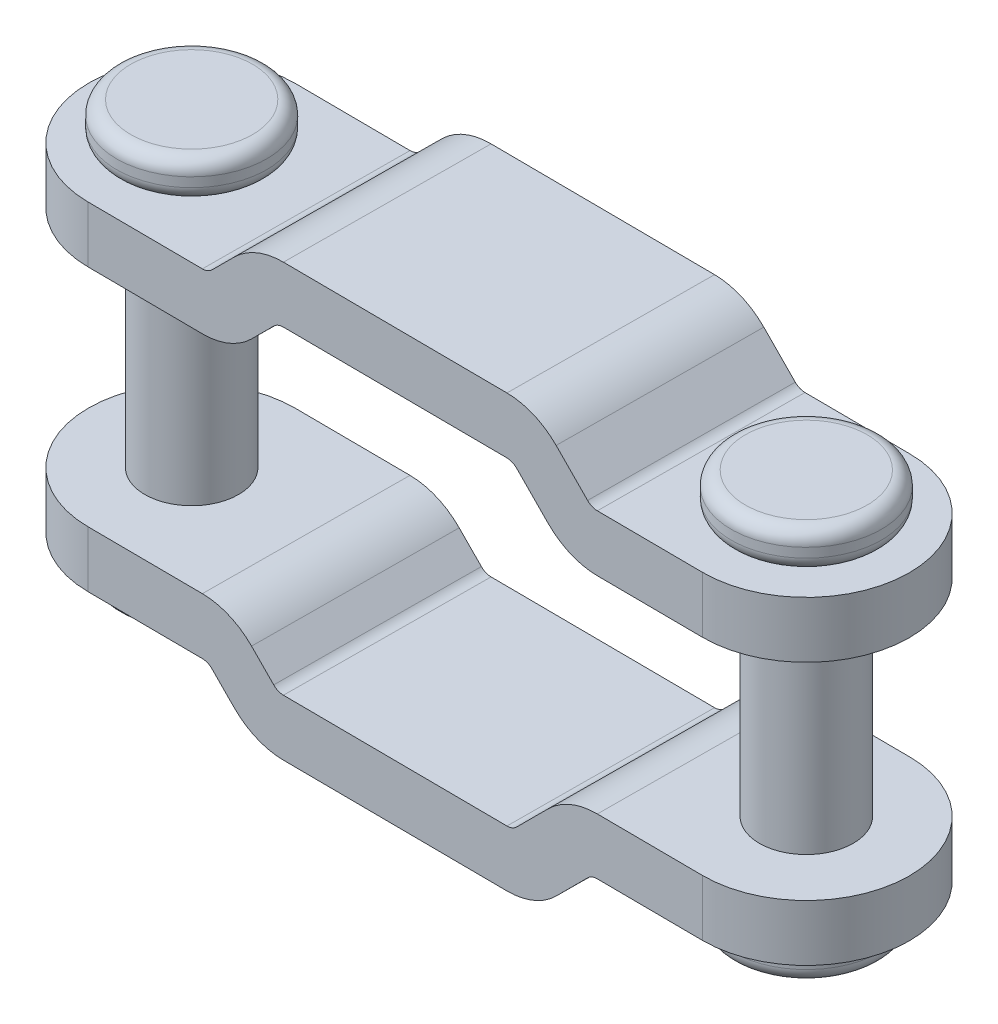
ISO-10303-21;
HEADER;
FILE_DESCRIPTION(('STEP AP214'),'2;1');
FILE_NAME('part.step','',(''),(''),'','','');
FILE_SCHEMA(('AUTOMOTIVE_DESIGN { 1 0 10303 214 1 1 1 1 }'));
ENDSEC;
DATA;
#1=APPLICATION_CONTEXT('core data for automotive mechanical design processes');
#2=APPLICATION_PROTOCOL_DEFINITION('international standard','automotive_design',2000,#1);
#3=PRODUCT_CONTEXT('',#1,'mechanical');
#4=PRODUCT('Part','Part','',(#3));
#5=PRODUCT_RELATED_PRODUCT_CATEGORY('part','',(#4));
#6=PRODUCT_DEFINITION_FORMATION('','',#4);
#7=PRODUCT_DEFINITION_CONTEXT('part definition',#1,'design');
#8=PRODUCT_DEFINITION('design','',#6,#7);
#9=PRODUCT_DEFINITION_SHAPE('','',#8);
#10=(LENGTH_UNIT() NAMED_UNIT(*) SI_UNIT(.MILLI.,.METRE.));
#11=(NAMED_UNIT(*) PLANE_ANGLE_UNIT() SI_UNIT($,.RADIAN.));
#12=(NAMED_UNIT(*) SI_UNIT($,.STERADIAN.) SOLID_ANGLE_UNIT());
#13=UNCERTAINTY_MEASURE_WITH_UNIT(LENGTH_MEASURE(1.E-05),#10,'distance_accuracy_value','');
#14=(GEOMETRIC_REPRESENTATION_CONTEXT(3) GLOBAL_UNCERTAINTY_ASSIGNED_CONTEXT((#13)) GLOBAL_UNIT_ASSIGNED_CONTEXT((#10,
#11,#12)) REPRESENTATION_CONTEXT('',''));
#15=CARTESIAN_POINT('',(0.,0.,0.));
#16=DIRECTION('',(0.,0.,1.));
#17=DIRECTION('',(1.,0.,0.));
#18=AXIS2_PLACEMENT_3D('',#15,#16,#17);
#19=CARTESIAN_POINT('',(-4.83929184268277,32.4500000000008,24.5));
#20=DIRECTION('',(0.,-1.,0.));
#21=DIRECTION('',(-0.908110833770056,0.,-0.418729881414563));
#22=AXIS2_PLACEMENT_3D('',#19,#20,#21);
#23=CYLINDRICAL_SURFACE('',#22,2.5);
#24=CARTESIAN_POINT('',(-4.83929184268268,18.4499999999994,24.5));
#25=DIRECTION('',(0.,-1.,0.));
#26=DIRECTION('',(1.,0.,0.));
#27=AXIS2_PLACEMENT_3D('',#24,#25,#26);
#28=CIRCLE('',#27,2.5);
#29=CARTESIAN_POINT('',(-2.33929184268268,18.4499999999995,24.5));
#30=VERTEX_POINT('',#29);
#31=EDGE_CURVE('E30',#30,#30,#28,.F.);
#32=ORIENTED_EDGE('',*,*,#31,.T.);
#33=EDGE_LOOP('',(#32));
#34=FACE_BOUND('',#33,.T.);
#35=CARTESIAN_POINT('',(-4.83929184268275,29.45,24.5));
#36=DIRECTION('',(0.,1.,0.));
#37=DIRECTION('',(-1.,0.,0.));
#38=AXIS2_PLACEMENT_3D('',#35,#36,#37);
#39=CIRCLE('',#38,2.5);
#40=CARTESIAN_POINT('',(-7.33929184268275,29.45,24.5));
#41=VERTEX_POINT('',#40);
#42=EDGE_CURVE('E11',#41,#41,#39,.F.);
#43=ORIENTED_EDGE('',*,*,#42,.T.);
#44=EDGE_LOOP('',(#43));
#45=FACE_BOUND('',#44,.T.);
#46=ADVANCED_FACE('F18',(#34,#45),#23,.T.);
#47=CARTESIAN_POINT('',(-4.83929184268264,13.4500000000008,24.5));
#48=DIRECTION('',(0.,1.,0.));
#49=DIRECTION('',(0.908110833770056,0.,0.418729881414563));
#50=AXIS2_PLACEMENT_3D('',#47,#48,#49);
#51=PLANE('',#50);
#52=CARTESIAN_POINT('',(-4.83929184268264,13.4500000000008,24.5));
#53=DIRECTION('',(0.,1.,0.));
#54=DIRECTION('',(0.908110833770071,0.,0.418729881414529));
#55=AXIS2_PLACEMENT_3D('',#52,#53,#54);
#56=CIRCLE('',#55,3.24999999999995);
#57=CARTESIAN_POINT('',(-1.88793163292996,13.4500000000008,25.8608721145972));
#58=VERTEX_POINT('',#57);
#59=CARTESIAN_POINT('',(-7.79065205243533,13.4500000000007,23.1391278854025));
#60=VERTEX_POINT('',#59);
#61=EDGE_CURVE('E1530',#58,#60,#56,.T.);
#62=ORIENTED_EDGE('',*,*,#61,.F.);
#63=CARTESIAN_POINT('',(-4.83929184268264,13.4500000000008,24.5));
#64=DIRECTION('',(0.,1.,0.));
#65=DIRECTION('',(-0.908110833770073,0.,-0.418729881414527));
#66=AXIS2_PLACEMENT_3D('',#63,#64,#65);
#67=CIRCLE('',#66,3.24999999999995);
#68=EDGE_CURVE('E1527',#60,#58,#67,.T.);
#69=ORIENTED_EDGE('',*,*,#68,.F.);
#70=EDGE_LOOP('',(#62,#69));
#71=FACE_BOUND('',#70,.T.);
#72=ADVANCED_FACE('F571',(#71),#51,.F.);
#73=CARTESIAN_POINT('',(-4.83929184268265,14.2000000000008,24.5));
#74=DIRECTION('',(0.,1.,0.));
#75=DIRECTION('',(0.908110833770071,0.,0.418729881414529));
#76=AXIS2_PLACEMENT_3D('',#73,#74,#75);
#77=TOROIDAL_SURFACE('',#76,3.24999999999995,0.75);
#78=ORIENTED_EDGE('',*,*,#61,.T.);
#79=ORIENTED_EDGE('',*,*,#68,.T.);
#80=EDGE_LOOP('',(#78,#79));
#81=FACE_BOUND('',#80,.T.);
#82=CARTESIAN_POINT('',(-4.83929184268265,14.2000000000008,24.5));
#83=DIRECTION('',(0.,-1.,0.));
#84=DIRECTION('',(-0.908110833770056,0.,-0.418729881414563));
#85=AXIS2_PLACEMENT_3D('',#82,#83,#84);
#86=CIRCLE('',#85,4.);
#87=CARTESIAN_POINT('',(-8.47173517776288,14.2000000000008,22.8250804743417));
#88=VERTEX_POINT('',#87);
#89=EDGE_CURVE('E1520',#88,#88,#86,.F.);
#90=ORIENTED_EDGE('',*,*,#89,.F.);
#91=EDGE_LOOP('',(#90));
#92=FACE_BOUND('',#91,.T.);
#93=ADVANCED_FACE('F580',(#81,#92),#77,.T.);
#94=CARTESIAN_POINT('',(-4.83929184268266,15.4500000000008,24.5));
#95=DIRECTION('',(0.,-1.,0.));
#96=DIRECTION('',(-0.908110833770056,0.,-0.418729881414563));
#97=AXIS2_PLACEMENT_3D('',#94,#95,#96);
#98=CYLINDRICAL_SURFACE('',#97,4.);
#99=CARTESIAN_POINT('',(-4.83929184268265,14.7000000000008,24.5));
#100=DIRECTION('',(0.,1.,0.));
#101=DIRECTION('',(0.908110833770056,0.,0.418729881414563));
#102=AXIS2_PLACEMENT_3D('',#99,#100,#101);
#103=CIRCLE('',#102,4.);
#104=CARTESIAN_POINT('',(-1.20684850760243,14.7000000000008,26.1749195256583));
#105=VERTEX_POINT('',#104);
#106=EDGE_CURVE('E1626',#105,#105,#103,.T.);
#107=ORIENTED_EDGE('',*,*,#106,.F.);
#108=EDGE_LOOP('',(#107));
#109=FACE_BOUND('',#108,.T.);
#110=ORIENTED_EDGE('',*,*,#89,.T.);
#111=EDGE_LOOP('',(#110));
#112=FACE_BOUND('',#111,.T.);
#113=ADVANCED_FACE('F1419',(#109,#112),#98,.T.);
#114=CARTESIAN_POINT('',(-4.83929184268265,14.7000000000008,24.5));
#115=DIRECTION('',(0.,1.,0.));
#116=DIRECTION('',(0.908110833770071,0.,0.418729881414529));
#117=AXIS2_PLACEMENT_3D('',#114,#115,#116);
#118=TOROIDAL_SURFACE('',#117,3.24999999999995,0.75);
#119=ORIENTED_EDGE('',*,*,#106,.T.);
#120=EDGE_LOOP('',(#119));
#121=FACE_BOUND('',#120,.T.);
#122=CARTESIAN_POINT('',(-4.83929184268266,15.4500000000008,24.5));
#123=DIRECTION('',(0.,-1.,0.));
#124=DIRECTION('',(0.908110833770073,0.,0.418729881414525));
#125=AXIS2_PLACEMENT_3D('',#122,#123,#124);
#126=CIRCLE('',#125,3.24999999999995);
#127=CARTESIAN_POINT('',(-7.79065205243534,15.4500000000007,23.1391278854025));
#128=VERTEX_POINT('',#127);
#129=CARTESIAN_POINT('',(-1.88793163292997,15.4500000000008,25.8608721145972));
#130=VERTEX_POINT('',#129);
#131=EDGE_CURVE('E38',#128,#130,#126,.F.);
#132=ORIENTED_EDGE('',*,*,#131,.F.);
#133=CARTESIAN_POINT('',(-4.83929184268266,15.4500000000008,24.5));
#134=DIRECTION('',(0.,-1.,0.));
#135=DIRECTION('',(-0.908110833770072,0.,-0.418729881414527));
#136=AXIS2_PLACEMENT_3D('',#133,#134,#135);
#137=CIRCLE('',#136,3.24999999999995);
#138=EDGE_CURVE('E1595',#130,#128,#137,.F.);
#139=ORIENTED_EDGE('',*,*,#138,.F.);
#140=EDGE_LOOP('',(#132,#139));
#141=FACE_BOUND('',#140,.T.);
#142=ADVANCED_FACE('F605',(#121,#141),#118,.T.);
#143=CARTESIAN_POINT('',(-4.83929184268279,34.4500000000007,24.5));
#144=DIRECTION('',(0.,-1.,0.));
#145=DIRECTION('',(-0.908110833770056,0.,-0.418729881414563));
#146=AXIS2_PLACEMENT_3D('',#143,#144,#145);
#147=PLANE('',#146);
#148=CARTESIAN_POINT('',(-4.83929184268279,34.4500000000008,24.5));
#149=DIRECTION('',(0.,-1.,0.));
#150=DIRECTION('',(-0.908110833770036,0.,-0.418729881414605));
#151=AXIS2_PLACEMENT_3D('',#148,#149,#150);
#152=CIRCLE('',#151,3.25000000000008);
#153=CARTESIAN_POINT('',(-7.79065205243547,34.4500000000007,23.1391278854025));
#154=VERTEX_POINT('',#153);
#155=CARTESIAN_POINT('',(-1.88793163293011,34.4500000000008,25.8608721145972));
#156=VERTEX_POINT('',#155);
#157=EDGE_CURVE('E1562',#154,#156,#152,.T.);
#158=ORIENTED_EDGE('',*,*,#157,.F.);
#159=CARTESIAN_POINT('',(-4.83929184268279,34.4500000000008,24.5));
#160=DIRECTION('',(0.,-1.,0.));
#161=DIRECTION('',(0.908110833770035,0.,0.418729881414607));
#162=AXIS2_PLACEMENT_3D('',#159,#160,#161);
#163=CIRCLE('',#162,3.25000000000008);
#164=EDGE_CURVE('E1573',#156,#154,#163,.T.);
#165=ORIENTED_EDGE('',*,*,#164,.F.);
#166=EDGE_LOOP('',(#158,#165));
#167=FACE_BOUND('',#166,.T.);
#168=ADVANCED_FACE('F1393',(#167),#147,.F.);
#169=CARTESIAN_POINT('',(-4.83929184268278,33.7000000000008,24.5));
#170=DIRECTION('',(0.,-1.,0.));
#171=DIRECTION('',(-0.908110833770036,0.,-0.418729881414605));
#172=AXIS2_PLACEMENT_3D('',#169,#170,#171);
#173=TOROIDAL_SURFACE('',#172,3.25000000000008,0.75);
#174=ORIENTED_EDGE('',*,*,#157,.T.);
#175=ORIENTED_EDGE('',*,*,#164,.T.);
#176=EDGE_LOOP('',(#174,#175));
#177=FACE_BOUND('',#176,.T.);
#178=CARTESIAN_POINT('',(-4.83929184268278,33.7000000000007,24.5));
#179=DIRECTION('',(0.,1.,0.));
#180=DIRECTION('',(0.908110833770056,0.,0.418729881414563));
#181=AXIS2_PLACEMENT_3D('',#178,#179,#180);
#182=CIRCLE('',#181,4.);
#183=CARTESIAN_POINT('',(-1.20684850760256,33.7000000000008,26.1749195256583));
#184=VERTEX_POINT('',#183);
#185=EDGE_CURVE('E1522',#184,#184,#182,.F.);
#186=ORIENTED_EDGE('',*,*,#185,.F.);
#187=EDGE_LOOP('',(#186));
#188=FACE_BOUND('',#187,.T.);
#189=ADVANCED_FACE('F1398',(#177,#188),#173,.T.);
#190=CARTESIAN_POINT('',(-4.83929184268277,32.4500000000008,24.5));
#191=DIRECTION('',(0.,1.,0.));
#192=DIRECTION('',(0.908110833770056,0.,0.418729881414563));
#193=AXIS2_PLACEMENT_3D('',#190,#191,#192);
#194=CYLINDRICAL_SURFACE('',#193,4.);
#195=CARTESIAN_POINT('',(-4.83929184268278,33.2000000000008,24.5));
#196=DIRECTION('',(0.,-1.,0.));
#197=DIRECTION('',(-0.908110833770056,0.,-0.418729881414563));
#198=AXIS2_PLACEMENT_3D('',#195,#196,#197);
#199=CIRCLE('',#198,4.);
#200=CARTESIAN_POINT('',(-8.471735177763,33.2000000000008,22.8250804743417));
#201=VERTEX_POINT('',#200);
#202=EDGE_CURVE('E1518',#201,#201,#199,.T.);
#203=ORIENTED_EDGE('',*,*,#202,.F.);
#204=EDGE_LOOP('',(#203));
#205=FACE_BOUND('',#204,.T.);
#206=ORIENTED_EDGE('',*,*,#185,.T.);
#207=EDGE_LOOP('',(#206));
#208=FACE_BOUND('',#207,.T.);
#209=ADVANCED_FACE('F602',(#205,#208),#194,.T.);
#210=CARTESIAN_POINT('',(-4.83929184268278,33.2000000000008,24.5));
#211=DIRECTION('',(0.,-1.,0.));
#212=DIRECTION('',(-0.908110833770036,0.,-0.418729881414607));
#213=AXIS2_PLACEMENT_3D('',#210,#211,#212);
#214=TOROIDAL_SURFACE('',#213,3.25000000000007,0.75);
#215=ORIENTED_EDGE('',*,*,#202,.T.);
#216=EDGE_LOOP('',(#215));
#217=FACE_BOUND('',#216,.T.);
#218=CARTESIAN_POINT('',(-4.83929184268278,32.4500000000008,24.5));
#219=DIRECTION('',(0.,1.,0.));
#220=DIRECTION('',(-0.908110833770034,0.,-0.418729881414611));
#221=AXIS2_PLACEMENT_3D('',#218,#219,#220);
#222=CIRCLE('',#221,3.25000000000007);
#223=CARTESIAN_POINT('',(-1.88793163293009,32.4500000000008,25.8608721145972));
#224=VERTEX_POINT('',#223);
#225=CARTESIAN_POINT('',(-7.79065205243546,32.4500000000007,23.1391278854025));
#226=VERTEX_POINT('',#225);
#227=EDGE_CURVE('E534',#224,#226,#222,.F.);
#228=ORIENTED_EDGE('',*,*,#227,.F.);
#229=CARTESIAN_POINT('',(-4.83929184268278,32.4500000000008,24.5));
#230=DIRECTION('',(0.,1.,0.));
#231=DIRECTION('',(0.908110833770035,0.,0.418729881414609));
#232=AXIS2_PLACEMENT_3D('',#229,#230,#231);
#233=CIRCLE('',#232,3.25000000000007);
#234=EDGE_CURVE('E1633',#226,#224,#233,.F.);
#235=ORIENTED_EDGE('',*,*,#234,.F.);
#236=EDGE_LOOP('',(#228,#235));
#237=FACE_BOUND('',#236,.T.);
#238=ADVANCED_FACE('F589',(#217,#237),#214,.T.);
#239=CARTESIAN_POINT('',(-37.8385473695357,34.9499999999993,24.2783365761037));
#240=DIRECTION('',(0.,-1.,0.));
#241=DIRECTION('',(0.531313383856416,0.,0.847175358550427));
#242=AXIS2_PLACEMENT_3D('',#239,#240,#241);
#243=PLANE('',#242);
#244=CARTESIAN_POINT('',(-37.8385473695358,34.9499999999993,24.2783365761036));
#245=DIRECTION('',(0.,-1.,0.));
#246=DIRECTION('',(0.531313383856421,0.,0.847175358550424));
#247=AXIS2_PLACEMENT_3D('',#244,#245,#246);
#248=CIRCLE('',#247,3.24999999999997);
#249=CARTESIAN_POINT('',(-36.1117788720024,34.9499999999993,27.0316564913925));
#250=VERTEX_POINT('',#249);
#251=CARTESIAN_POINT('',(-39.5653158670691,34.9499999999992,21.5250166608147));
#252=VERTEX_POINT('',#251);
#253=EDGE_CURVE('E724',#250,#252,#248,.T.);
#254=ORIENTED_EDGE('',*,*,#253,.F.);
#255=CARTESIAN_POINT('',(-37.8385473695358,34.9499999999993,24.2783365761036));
#256=DIRECTION('',(0.,-1.,0.));
#257=DIRECTION('',(-0.531313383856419,0.,-0.847175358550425));
#258=AXIS2_PLACEMENT_3D('',#255,#256,#257);
#259=CIRCLE('',#258,3.24999999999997);
#260=EDGE_CURVE('E1714',#252,#250,#259,.T.);
#261=ORIENTED_EDGE('',*,*,#260,.F.);
#262=EDGE_LOOP('',(#254,#261));
#263=FACE_BOUND('',#262,.T.);
#264=ADVANCED_FACE('F575',(#263),#243,.F.);
#265=CARTESIAN_POINT('',(-37.8385473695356,12.9499999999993,24.2783365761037));
#266=DIRECTION('',(0.,1.,0.));
#267=DIRECTION('',(-0.531313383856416,0.,-0.847175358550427));
#268=AXIS2_PLACEMENT_3D('',#265,#266,#267);
#269=PLANE('',#268);
#270=CARTESIAN_POINT('',(-37.8385473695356,12.9499999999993,24.2783365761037));
#271=DIRECTION('',(0.,1.,0.));
#272=DIRECTION('',(-0.531313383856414,0.,-0.847175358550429));
#273=AXIS2_PLACEMENT_3D('',#270,#271,#272);
#274=CIRCLE('',#273,3.25000000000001);
#275=CARTESIAN_POINT('',(-39.5653158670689,12.9499999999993,21.5250166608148));
#276=VERTEX_POINT('',#275);
#277=CARTESIAN_POINT('',(-36.1117788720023,12.9499999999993,27.0316564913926));
#278=VERTEX_POINT('',#277);
#279=EDGE_CURVE('E1760',#276,#278,#274,.T.);
#280=ORIENTED_EDGE('',*,*,#279,.F.);
#281=CARTESIAN_POINT('',(-37.8385473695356,12.9499999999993,24.2783365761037));
#282=DIRECTION('',(0.,1.,0.));
#283=DIRECTION('',(0.531313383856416,0.,0.847175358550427));
#284=AXIS2_PLACEMENT_3D('',#281,#282,#283);
#285=CIRCLE('',#284,3.25000000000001);
#286=EDGE_CURVE('E1761',#278,#276,#285,.T.);
#287=ORIENTED_EDGE('',*,*,#286,.F.);
#288=EDGE_LOOP('',(#280,#287));
#289=FACE_BOUND('',#288,.T.);
#290=ADVANCED_FACE('F588',(#289),#269,.F.);
#291=CARTESIAN_POINT('',(-37.8385473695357,34.1999999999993,24.2783365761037));
#292=DIRECTION('',(0.,-1.,0.));
#293=DIRECTION('',(0.531313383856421,0.,0.847175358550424));
#294=AXIS2_PLACEMENT_3D('',#291,#292,#293);
#295=TOROIDAL_SURFACE('',#294,3.24999999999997,0.75);
#296=ORIENTED_EDGE('',*,*,#253,.T.);
#297=ORIENTED_EDGE('',*,*,#260,.T.);
#298=EDGE_LOOP('',(#296,#297));
#299=FACE_BOUND('',#298,.T.);
#300=CARTESIAN_POINT('',(-37.8385473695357,34.1999999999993,24.2783365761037));
#301=DIRECTION('',(0.,1.,0.));
#302=DIRECTION('',(-0.531313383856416,0.,-0.847175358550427));
#303=AXIS2_PLACEMENT_3D('',#300,#301,#302);
#304=CIRCLE('',#303,4.);
#305=CARTESIAN_POINT('',(-39.9638009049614,34.1999999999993,20.8896351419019));
#306=VERTEX_POINT('',#305);
#307=EDGE_CURVE('E1764',#306,#306,#304,.F.);
#308=ORIENTED_EDGE('',*,*,#307,.F.);
#309=EDGE_LOOP('',(#308));
#310=FACE_BOUND('',#309,.T.);
#311=ADVANCED_FACE('F592',(#299,#310),#295,.T.);
#312=CARTESIAN_POINT('',(-37.8385473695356,13.6999999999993,24.2783365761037));
#313=DIRECTION('',(0.,1.,0.));
#314=DIRECTION('',(-0.531313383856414,0.,-0.847175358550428));
#315=AXIS2_PLACEMENT_3D('',#312,#313,#314);
#316=TOROIDAL_SURFACE('',#315,3.25000000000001,0.75);
#317=ORIENTED_EDGE('',*,*,#279,.T.);
#318=ORIENTED_EDGE('',*,*,#286,.T.);
#319=EDGE_LOOP('',(#317,#318));
#320=FACE_BOUND('',#319,.T.);
#321=CARTESIAN_POINT('',(-37.8385473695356,13.6999999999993,24.2783365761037));
#322=DIRECTION('',(0.,-1.,0.));
#323=DIRECTION('',(0.531313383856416,0.,0.847175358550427));
#324=AXIS2_PLACEMENT_3D('',#321,#322,#323);
#325=CIRCLE('',#324,4.);
#326=CARTESIAN_POINT('',(-35.7132938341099,13.6999999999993,27.6670380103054));
#327=VERTEX_POINT('',#326);
#328=EDGE_CURVE('E701',#327,#327,#325,.F.);
#329=ORIENTED_EDGE('',*,*,#328,.F.);
#330=EDGE_LOOP('',(#329));
#331=FACE_BOUND('',#330,.T.);
#332=ADVANCED_FACE('F601',(#320,#331),#316,.T.);
#333=CARTESIAN_POINT('',(-37.8385473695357,32.9499999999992,24.2783365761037));
#334=DIRECTION('',(0.,1.,0.));
#335=DIRECTION('',(-0.531313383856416,0.,-0.847175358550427));
#336=AXIS2_PLACEMENT_3D('',#333,#334,#335);
#337=CYLINDRICAL_SURFACE('',#336,4.);
#338=CARTESIAN_POINT('',(-37.8385473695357,33.6999999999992,24.2783365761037));
#339=DIRECTION('',(0.,-1.,0.));
#340=DIRECTION('',(0.531313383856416,0.,0.847175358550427));
#341=AXIS2_PLACEMENT_3D('',#338,#339,#340);
#342=CIRCLE('',#341,4.);
#343=CARTESIAN_POINT('',(-35.7132938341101,33.6999999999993,27.6670380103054));
#344=VERTEX_POINT('',#343);
#345=EDGE_CURVE('E699',#344,#344,#342,.T.);
#346=ORIENTED_EDGE('',*,*,#345,.F.);
#347=EDGE_LOOP('',(#346));
#348=FACE_BOUND('',#347,.T.);
#349=ORIENTED_EDGE('',*,*,#307,.T.);
#350=EDGE_LOOP('',(#349));
#351=FACE_BOUND('',#350,.T.);
#352=ADVANCED_FACE('F611',(#348,#351),#337,.T.);
#353=CARTESIAN_POINT('',(-37.8385473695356,14.9499999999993,24.2783365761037));
#354=DIRECTION('',(0.,-1.,0.));
#355=DIRECTION('',(0.531313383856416,0.,0.847175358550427));
#356=AXIS2_PLACEMENT_3D('',#353,#354,#355);
#357=CYLINDRICAL_SURFACE('',#356,4.);
#358=CARTESIAN_POINT('',(-37.8385473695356,14.1999999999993,24.2783365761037));
#359=DIRECTION('',(0.,1.,0.));
#360=DIRECTION('',(-0.531313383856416,0.,-0.847175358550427));
#361=AXIS2_PLACEMENT_3D('',#358,#359,#360);
#362=CIRCLE('',#361,4.);
#363=CARTESIAN_POINT('',(-39.9638009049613,14.1999999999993,20.889635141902));
#364=VERTEX_POINT('',#363);
#365=EDGE_CURVE('E691',#364,#364,#362,.T.);
#366=ORIENTED_EDGE('',*,*,#365,.F.);
#367=EDGE_LOOP('',(#366));
#368=FACE_BOUND('',#367,.T.);
#369=ORIENTED_EDGE('',*,*,#328,.T.);
#370=EDGE_LOOP('',(#369));
#371=FACE_BOUND('',#370,.T.);
#372=ADVANCED_FACE('F618',(#368,#371),#357,.T.);
#373=CARTESIAN_POINT('',(-37.8385473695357,32.9499999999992,24.2783365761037));
#374=DIRECTION('',(0.,-1.,0.));
#375=DIRECTION('',(0.531313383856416,0.,0.847175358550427));
#376=AXIS2_PLACEMENT_3D('',#373,#374,#375);
#377=CYLINDRICAL_SURFACE('',#376,2.5);
#378=CARTESIAN_POINT('',(-37.8385473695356,17.9499999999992,24.2783365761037));
#379=DIRECTION('',(0.,1.,0.));
#380=DIRECTION('',(0.999977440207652,0.,0.00671707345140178));
#381=AXIS2_PLACEMENT_3D('',#378,#379,#380);
#382=CIRCLE('',#381,2.5);
#383=CARTESIAN_POINT('',(-35.3386037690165,17.9499999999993,24.2951292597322));
#384=VERTEX_POINT('',#383);
#385=EDGE_CURVE('E429',#384,#384,#382,.F.);
#386=ORIENTED_EDGE('',*,*,#385,.F.);
#387=EDGE_LOOP('',(#386));
#388=FACE_BOUND('',#387,.T.);
#389=CARTESIAN_POINT('',(-37.8385473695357,29.95,24.2783365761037));
#390=DIRECTION('',(0.,-1.,0.));
#391=DIRECTION('',(0.999977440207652,0.,0.00671707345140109));
#392=AXIS2_PLACEMENT_3D('',#389,#390,#391);
#393=CIRCLE('',#392,2.5);
#394=CARTESIAN_POINT('',(-35.3386037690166,29.95,24.2951292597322));
#395=VERTEX_POINT('',#394);
#396=EDGE_CURVE('E427',#395,#395,#393,.F.);
#397=ORIENTED_EDGE('',*,*,#396,.F.);
#398=EDGE_LOOP('',(#397));
#399=FACE_BOUND('',#398,.T.);
#400=ADVANCED_FACE('F629',(#388,#399),#377,.T.);
#401=CARTESIAN_POINT('',(-37.8385473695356,14.1999999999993,24.2783365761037));
#402=DIRECTION('',(0.,1.,0.));
#403=DIRECTION('',(-0.531313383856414,0.,-0.847175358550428));
#404=AXIS2_PLACEMENT_3D('',#401,#402,#403);
#405=TOROIDAL_SURFACE('',#404,3.25000000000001,0.75);
#406=ORIENTED_EDGE('',*,*,#365,.T.);
#407=EDGE_LOOP('',(#406));
#408=FACE_BOUND('',#407,.T.);
#409=CARTESIAN_POINT('',(-37.8385473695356,14.9499999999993,24.2783365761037));
#410=DIRECTION('',(0.,-1.,0.));
#411=DIRECTION('',(-0.531313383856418,0.,-0.847175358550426));
#412=AXIS2_PLACEMENT_3D('',#409,#410,#411);
#413=CIRCLE('',#412,3.25000000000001);
#414=CARTESIAN_POINT('',(-36.1117788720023,14.9499999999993,27.0316564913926));
#415=VERTEX_POINT('',#414);
#416=CARTESIAN_POINT('',(-39.565315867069,14.9499999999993,21.5250166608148));
#417=VERTEX_POINT('',#416);
#418=EDGE_CURVE('E430',#415,#417,#413,.F.);
#419=ORIENTED_EDGE('',*,*,#418,.F.);
#420=CARTESIAN_POINT('',(-37.8385473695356,14.9499999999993,24.2783365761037));
#421=DIRECTION('',(0.,-1.,0.));
#422=DIRECTION('',(0.531313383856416,0.,0.847175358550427));
#423=AXIS2_PLACEMENT_3D('',#420,#421,#422);
#424=CIRCLE('',#423,3.25000000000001);
#425=EDGE_CURVE('E1722',#417,#415,#424,.F.);
#426=ORIENTED_EDGE('',*,*,#425,.F.);
#427=EDGE_LOOP('',(#419,#426));
#428=FACE_BOUND('',#427,.T.);
#429=ADVANCED_FACE('F632',(#408,#428),#405,.T.);
#430=CARTESIAN_POINT('',(-15.2615649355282,16.1865999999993,12.8934525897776));
#431=DIRECTION('',(-0.00671707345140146,0.,0.999977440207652));
#432=DIRECTION('',(0.999977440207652,0.,0.00671707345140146));
#433=AXIS2_PLACEMENT_3D('',#430,#431,#432);
#434=CYLINDRICAL_SURFACE('',#433,3.7366);
#435=CARTESIAN_POINT('',(-15.3021110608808,16.1865999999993,18.9295948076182));
#436=DIRECTION('',(-0.00671707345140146,0.,0.999977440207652));
#437=DIRECTION('',(0.999977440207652,0.,0.00671707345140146));
#438=AXIS2_PLACEMENT_3D('',#435,#436,#437);
#439=CIRCLE('',#438,3.7366);
#440=CARTESIAN_POINT('',(-15.3021110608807,12.4499999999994,18.9295948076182));
#441=VERTEX_POINT('',#440);
#442=CARTESIAN_POINT('',(-12.6599954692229,13.5444248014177,18.9473424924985));
#443=VERTEX_POINT('',#442);
#444=EDGE_CURVE('E768',#441,#443,#439,.T.);
#445=ORIENTED_EDGE('',*,*,#444,.T.);
#446=DIRECTION('',(-0.00671707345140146,0.,0.999977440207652));
#447=VECTOR('',#446,1.);
#448=CARTESIAN_POINT('',(-12.6194493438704,13.5444248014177,12.911200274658));
#449=LINE('',#448,#447);
#450=CARTESIAN_POINT('',(-12.7338832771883,13.5444248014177,29.9470943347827));
#451=VERTEX_POINT('',#450);
#452=EDGE_CURVE('E757',#443,#451,#449,.T.);
#453=ORIENTED_EDGE('',*,*,#452,.T.);
#454=CARTESIAN_POINT('',(-15.3759988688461,16.1865999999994,29.9293466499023));
#455=DIRECTION('',(-0.00671707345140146,0.,0.999977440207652));
#456=DIRECTION('',(0.999977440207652,0.,0.00671707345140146));
#457=AXIS2_PLACEMENT_3D('',#454,#455,#456);
#458=CIRCLE('',#457,3.7366);
#459=CARTESIAN_POINT('',(-15.3759988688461,12.4499999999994,29.9293466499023));
#460=VERTEX_POINT('',#459);
#461=EDGE_CURVE('E779',#451,#460,#458,.F.);
#462=ORIENTED_EDGE('',*,*,#461,.T.);
#463=DIRECTION('',(0.00671707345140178,0.,-0.999977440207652));
#464=VECTOR('',#463,1.);
#465=CARTESIAN_POINT('',(-15.3759988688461,12.4499999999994,29.9293466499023));
#466=LINE('',#465,#464);
#467=EDGE_CURVE('E742',#441,#460,#466,.F.);
#468=ORIENTED_EDGE('',*,*,#467,.F.);
#469=EDGE_LOOP('',(#445,#453,#462,#468));
#470=FACE_BOUND('',#469,.T.);
#471=ADVANCED_FACE('F652',(#470),#434,.T.);
#472=CARTESIAN_POINT('',(-35.8957899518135,-9.61800441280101,29.791510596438));
#473=DIRECTION('',(0.707090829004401,-0.707106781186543,0.00474968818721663));
#474=DIRECTION('',(-0.707090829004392,-0.707106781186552,-0.00474968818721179));
#475=AXIS2_PLACEMENT_3D('',#472,#473,#474);
#476=PLANE('',#475);
#477=DIRECTION('',(-0.707090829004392,-0.707106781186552,-0.00474968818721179));
#478=VECTOR('',#477,1.);
#479=CARTESIAN_POINT('',(-35.8957899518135,-9.61800441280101,29.791510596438));
#480=LINE('',#479,#478);
#481=CARTESIAN_POINT('',(-11.0440913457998,15.2342548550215,29.9584450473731));
#482=VERTEX_POINT('',#481);
#483=EDGE_CURVE('E774',#482,#451,#480,.T.);
#484=ORIENTED_EDGE('',*,*,#483,.T.);
#485=ORIENTED_EDGE('',*,*,#452,.F.);
#486=DIRECTION('',(-0.707090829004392,-0.707106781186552,-0.00474968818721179));
#487=VECTOR('',#486,1.);
#488=CARTESIAN_POINT('',(-35.821902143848,-9.61800441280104,18.7917587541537));
#489=LINE('',#488,#487);
#490=CARTESIAN_POINT('',(-10.9702035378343,15.2342548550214,18.9586932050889));
#491=VERTEX_POINT('',#490);
#492=EDGE_CURVE('E769',#443,#491,#489,.F.);
#493=ORIENTED_EDGE('',*,*,#492,.T.);
#494=DIRECTION('',(0.00671707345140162,0.,-0.999977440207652));
#495=VECTOR('',#494,1.);
#496=CARTESIAN_POINT('',(-11.0440913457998,15.2342548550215,29.9584450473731));
#497=LINE('',#496,#495);
#498=EDGE_CURVE('E772',#491,#482,#497,.F.);
#499=ORIENTED_EDGE('',*,*,#498,.T.);
#500=EDGE_LOOP('',(#484,#485,#493,#499));
#501=FACE_BOUND('',#500,.T.);
#502=ADVANCED_FACE('F659',(#501),#476,.T.);
#503=CARTESIAN_POINT('',(-38.0170624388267,-7.49668406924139,29.7772615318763));
#504=DIRECTION('',(0.707090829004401,-0.707106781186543,0.00474968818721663));
#505=DIRECTION('',(-0.707090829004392,-0.707106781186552,-0.00474968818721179));
#506=AXIS2_PLACEMENT_3D('',#503,#504,#505);
#507=PLANE('',#506);
#508=DIRECTION('',(0.707090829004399,0.707106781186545,0.00474968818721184));
#509=VECTOR('',#508,1.);
#510=CARTESIAN_POINT('',(-14.7812679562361,15.6657451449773,18.9330934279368));
#511=LINE('',#510,#509);
#512=CARTESIAN_POINT('',(-14.7812679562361,15.6657451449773,18.9330934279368));
#513=VERTEX_POINT('',#512);
#514=CARTESIAN_POINT('',(-13.0914760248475,17.3555751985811,18.9444441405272));
#515=VERTEX_POINT('',#514);
#516=EDGE_CURVE('E795',#513,#515,#511,.T.);
#517=ORIENTED_EDGE('',*,*,#516,.F.);
#518=DIRECTION('',(-0.00671707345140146,0.,0.999977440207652));
#519=VECTOR('',#518,1.);
#520=CARTESIAN_POINT('',(-14.7407218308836,15.6657451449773,12.8969512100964));
#521=LINE('',#520,#519);
#522=CARTESIAN_POINT('',(-14.8551557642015,15.6657451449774,29.9328452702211));
#523=VERTEX_POINT('',#522);
#524=EDGE_CURVE('E785',#513,#523,#521,.T.);
#525=ORIENTED_EDGE('',*,*,#524,.T.);
#526=DIRECTION('',(-0.707090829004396,-0.707106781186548,-0.00474968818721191));
#527=VECTOR('',#526,1.);
#528=CARTESIAN_POINT('',(-13.165363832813,17.3555751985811,29.9441959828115));
#529=LINE('',#528,#527);
#530=CARTESIAN_POINT('',(-13.165363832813,17.3555751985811,29.9441959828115));
#531=VERTEX_POINT('',#530);
#532=EDGE_CURVE('E788',#531,#523,#529,.T.);
#533=ORIENTED_EDGE('',*,*,#532,.F.);
#534=DIRECTION('',(0.00671707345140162,0.,-0.999977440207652));
#535=VECTOR('',#534,1.);
#536=CARTESIAN_POINT('',(-13.165363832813,17.3555751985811,29.9441959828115));
#537=LINE('',#536,#535);
#538=EDGE_CURVE('E816',#515,#531,#537,.F.);
#539=ORIENTED_EDGE('',*,*,#538,.F.);
#540=EDGE_LOOP('',(#517,#525,#533,#539));
#541=FACE_BOUND('',#540,.T.);
#542=ADVANCED_FACE('F488',(#541),#507,.F.);
#543=CARTESIAN_POINT('',(-15.2615649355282,16.1865999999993,12.8934525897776));
#544=DIRECTION('',(-0.00671707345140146,0.,0.999977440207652));
#545=DIRECTION('',(0.999977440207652,0.,0.00671707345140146));
#546=AXIS2_PLACEMENT_3D('',#543,#544,#545);
#547=CYLINDRICAL_SURFACE('',#546,0.7366);
#548=ORIENTED_EDGE('',*,*,#524,.F.);
#549=CARTESIAN_POINT('',(-15.3021110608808,16.1865999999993,18.9295948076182));
#550=DIRECTION('',(-0.00671707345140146,0.,0.999977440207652));
#551=DIRECTION('',(0.999977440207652,0.,0.00671707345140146));
#552=AXIS2_PLACEMENT_3D('',#549,#550,#551);
#553=CIRCLE('',#552,0.7366);
#554=CARTESIAN_POINT('',(-15.3021110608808,15.4499999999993,18.9295948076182));
#555=VERTEX_POINT('',#554);
#556=EDGE_CURVE('E773',#555,#513,#553,.T.);
#557=ORIENTED_EDGE('',*,*,#556,.F.);
#558=DIRECTION('',(0.00671707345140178,0.,-0.999977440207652));
#559=VECTOR('',#558,1.);
#560=CARTESIAN_POINT('',(-15.3759988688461,15.4499999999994,29.9293466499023));
#561=LINE('',#560,#559);
#562=CARTESIAN_POINT('',(-15.3759988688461,15.4499999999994,29.9293466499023));
#563=VERTEX_POINT('',#562);
#564=EDGE_CURVE('E761',#555,#563,#561,.F.);
#565=ORIENTED_EDGE('',*,*,#564,.T.);
#566=CARTESIAN_POINT('',(-15.3759988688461,16.1865999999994,29.9293466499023));
#567=DIRECTION('',(-0.00671707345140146,0.,0.999977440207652));
#568=DIRECTION('',(0.999977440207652,0.,0.00671707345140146));
#569=AXIS2_PLACEMENT_3D('',#566,#567,#568);
#570=CIRCLE('',#569,0.7366);
#571=EDGE_CURVE('E762',#523,#563,#570,.F.);
#572=ORIENTED_EDGE('',*,*,#571,.F.);
#573=EDGE_LOOP('',(#548,#557,#565,#572));
#574=FACE_BOUND('',#573,.T.);
#575=ADVANCED_FACE('F1119',(#574),#547,.F.);
#576=CARTESIAN_POINT('',(-46.3752995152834,15.4499999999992,29.7211173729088));
#577=DIRECTION('',(0.,-1.,0.));
#578=DIRECTION('',(-0.999977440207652,0.,-0.00671707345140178));
#579=AXIS2_PLACEMENT_3D('',#576,#577,#578);
#580=PLANE('',#579);
#581=DIRECTION('',(-0.999977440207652,0.,-0.00671707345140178));
#582=VECTOR('',#581,1.);
#583=CARTESIAN_POINT('',(-46.301411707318,15.4499999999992,18.7213655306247));
#584=LINE('',#583,#582);
#585=CARTESIAN_POINT('',(-27.3018403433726,15.4499999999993,18.8489899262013));
#586=VERTEX_POINT('',#585);
#587=EDGE_CURVE('E750',#586,#555,#584,.F.);
#588=ORIENTED_EDGE('',*,*,#587,.F.);
#589=DIRECTION('',(0.00671707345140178,0.,-0.999977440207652));
#590=VECTOR('',#589,1.);
#591=CARTESIAN_POINT('',(-27.375728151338,15.4499999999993,29.8487417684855));
#592=LINE('',#591,#590);
#593=CARTESIAN_POINT('',(-27.375728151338,15.4499999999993,29.8487417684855));
#594=VERTEX_POINT('',#593);
#595=EDGE_CURVE('E758',#594,#586,#592,.T.);
#596=ORIENTED_EDGE('',*,*,#595,.F.);
#597=DIRECTION('',(0.999977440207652,0.,0.00671707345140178));
#598=VECTOR('',#597,1.);
#599=CARTESIAN_POINT('',(-46.3752995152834,15.4499999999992,29.7211173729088));
#600=LINE('',#599,#598);
#601=EDGE_CURVE('E754',#563,#594,#600,.F.);
#602=ORIENTED_EDGE('',*,*,#601,.F.);
#603=ORIENTED_EDGE('',*,*,#564,.F.);
#604=EDGE_LOOP('',(#588,#596,#602,#603));
#605=FACE_BOUND('',#604,.T.);
#606=ADVANCED_FACE('F1123',(#605),#580,.F.);
#607=CARTESIAN_POINT('',(-27.4162742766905,16.1865999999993,35.884883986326));
#608=DIRECTION('',(0.00671707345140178,0.,-0.999977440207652));
#609=DIRECTION('',(-0.999977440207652,0.,-0.00671707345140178));
#610=AXIS2_PLACEMENT_3D('',#607,#608,#609);
#611=CYLINDRICAL_SURFACE('',#610,0.7366);
#612=CARTESIAN_POINT('',(-27.3018403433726,16.1865999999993,18.8489899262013));
#613=DIRECTION('',(0.00671707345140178,0.,-0.999977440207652));
#614=DIRECTION('',(-0.999977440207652,0.,-0.00671707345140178));
#615=AXIS2_PLACEMENT_3D('',#612,#613,#614);
#616=CIRCLE('',#615,0.7366);
#617=CARTESIAN_POINT('',(-27.8226834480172,15.6657451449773,18.8454913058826));
#618=VERTEX_POINT('',#617);
#619=EDGE_CURVE('E787',#618,#586,#616,.F.);
#620=ORIENTED_EDGE('',*,*,#619,.F.);
#621=DIRECTION('',(0.00671707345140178,0.,-0.999977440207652));
#622=VECTOR('',#621,1.);
#623=CARTESIAN_POINT('',(-27.9371173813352,15.6657451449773,35.8813853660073));
#624=LINE('',#623,#622);
#625=CARTESIAN_POINT('',(-27.8965712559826,15.6657451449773,29.8452431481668));
#626=VERTEX_POINT('',#625);
#627=EDGE_CURVE('E811',#626,#618,#624,.T.);
#628=ORIENTED_EDGE('',*,*,#627,.F.);
#629=CARTESIAN_POINT('',(-27.375728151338,16.1865999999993,29.8487417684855));
#630=DIRECTION('',(0.00671707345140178,0.,-0.999977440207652));
#631=DIRECTION('',(-0.999977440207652,0.,-0.00671707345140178));
#632=AXIS2_PLACEMENT_3D('',#629,#630,#631);
#633=CIRCLE('',#632,0.7366);
#634=EDGE_CURVE('E791',#594,#626,#633,.T.);
#635=ORIENTED_EDGE('',*,*,#634,.F.);
#636=ORIENTED_EDGE('',*,*,#595,.T.);
#637=EDGE_LOOP('',(#620,#628,#635,#636));
#638=FACE_BOUND('',#637,.T.);
#639=ADVANCED_FACE('F1064',(#638),#611,.F.);
#640=CARTESIAN_POINT('',(-40.0892060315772,27.8586549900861,29.7633424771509));
#641=DIRECTION('',(-0.707090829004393,-0.707106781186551,-0.0047496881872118));
#642=DIRECTION('',(-0.707090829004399,0.707106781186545,-0.00474968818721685));
#643=AXIS2_PLACEMENT_3D('',#640,#641,#642);
#644=PLANE('',#643);
#645=DIRECTION('',(0.00671707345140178,0.,-0.999977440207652));
#646=VECTOR('',#645,1.);
#647=CARTESIAN_POINT('',(-29.0863744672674,16.855575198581,29.8372509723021));
#648=LINE('',#647,#646);
#649=CARTESIAN_POINT('',(-29.0863744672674,16.855575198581,29.8372509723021));
#650=VERTEX_POINT('',#649);
#651=CARTESIAN_POINT('',(-29.0124866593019,16.8555751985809,18.8374991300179));
#652=VERTEX_POINT('',#651);
#653=EDGE_CURVE('E817',#650,#652,#648,.T.);
#654=ORIENTED_EDGE('',*,*,#653,.F.);
#655=DIRECTION('',(-0.707090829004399,0.707106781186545,-0.00474968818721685));
#656=VECTOR('',#655,1.);
#657=CARTESIAN_POINT('',(-40.0892060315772,27.8586549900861,29.7633424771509));
#658=LINE('',#657,#656);
#659=EDGE_CURVE('E818',#626,#650,#658,.T.);
#660=ORIENTED_EDGE('',*,*,#659,.F.);
#661=ORIENTED_EDGE('',*,*,#627,.T.);
#662=DIRECTION('',(-0.707090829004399,0.707106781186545,-0.00474968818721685));
#663=VECTOR('',#662,1.);
#664=CARTESIAN_POINT('',(-40.0153182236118,27.858654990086,18.7635906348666));
#665=LINE('',#664,#663);
#666=EDGE_CURVE('E814',#652,#618,#665,.F.);
#667=ORIENTED_EDGE('',*,*,#666,.F.);
#668=EDGE_LOOP('',(#654,#660,#661,#667));
#669=FACE_BOUND('',#668,.T.);
#670=ADVANCED_FACE('F520',(#669),#644,.F.);
#671=CARTESIAN_POINT('',(-31.7720461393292,14.2133999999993,36.3037405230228));
#672=DIRECTION('',(0.00671707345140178,0.,-0.999977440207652));
#673=DIRECTION('',(-0.999977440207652,0.,-0.00671707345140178));
#674=AXIS2_PLACEMENT_3D('',#671,#672,#673);
#675=CYLINDRICAL_SURFACE('',#674,3.7366);
#676=DIRECTION('',(0.00671707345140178,0.,-0.999977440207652));
#677=VECTOR('',#676,1.);
#678=CARTESIAN_POINT('',(-31.7720461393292,17.9499999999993,36.3037405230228));
#679=LINE('',#678,#677);
#680=CARTESIAN_POINT('',(-31.6546022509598,17.9499999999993,18.8197514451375));
#681=VERTEX_POINT('',#680);
#682=CARTESIAN_POINT('',(-31.7284900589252,17.9499999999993,29.8195032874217));
#683=VERTEX_POINT('',#682);
#684=EDGE_CURVE('E837',#681,#683,#679,.F.);
#685=ORIENTED_EDGE('',*,*,#684,.T.);
#686=CARTESIAN_POINT('',(-31.7284900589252,14.2133999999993,29.8195032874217));
#687=DIRECTION('',(0.00671707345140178,0.,-0.999977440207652));
#688=DIRECTION('',(-0.999977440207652,0.,-0.00671707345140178));
#689=AXIS2_PLACEMENT_3D('',#686,#687,#688);
#690=CIRCLE('',#689,3.7366);
#691=EDGE_CURVE('E807',#683,#650,#690,.T.);
#692=ORIENTED_EDGE('',*,*,#691,.T.);
#693=ORIENTED_EDGE('',*,*,#653,.T.);
#694=CARTESIAN_POINT('',(-31.6546022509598,14.2133999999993,18.8197514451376));
#695=DIRECTION('',(0.00671707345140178,0.,-0.999977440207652));
#696=DIRECTION('',(-0.999977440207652,0.,-0.00671707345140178));
#697=AXIS2_PLACEMENT_3D('',#694,#695,#696);
#698=CIRCLE('',#697,3.7366);
#699=EDGE_CURVE('E799',#652,#681,#698,.F.);
#700=ORIENTED_EDGE('',*,*,#699,.T.);
#701=EDGE_LOOP('',(#685,#692,#693,#700));
#702=FACE_BOUND('',#701,.T.);
#703=ADVANCED_FACE('F519',(#702),#675,.T.);
#704=CARTESIAN_POINT('',(-45.5322617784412,17.9499999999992,29.7267802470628));
#705=DIRECTION('',(0.,-1.,0.));
#706=DIRECTION('',(-0.999977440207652,0.,-0.00671707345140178));
#707=AXIS2_PLACEMENT_3D('',#704,#705,#706);
#708=PLANE('',#707);
#709=CARTESIAN_POINT('',(-37.8385473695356,17.9499999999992,24.2783365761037));
#710=DIRECTION('',(0.,-1.,0.));
#711=DIRECTION('',(-0.999977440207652,0.,-0.00671707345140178));
#712=AXIS2_PLACEMENT_3D('',#709,#710,#711);
#713=CIRCLE('',#712,5.5);
#714=CARTESIAN_POINT('',(-37.8754912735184,17.9499999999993,29.7782124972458));
#715=VERTEX_POINT('',#714);
#716=CARTESIAN_POINT('',(-37.801603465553,17.9499999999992,18.7784606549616));
#717=VERTEX_POINT('',#716);
#718=EDGE_CURVE('E840',#715,#717,#713,.T.);
#719=ORIENTED_EDGE('',*,*,#718,.F.);
#720=DIRECTION('',(0.999977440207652,0.,0.00671707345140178));
#721=VECTOR('',#720,1.);
#722=CARTESIAN_POINT('',(-45.5322617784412,17.9499999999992,29.7267802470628));
#723=LINE('',#722,#721);
#724=EDGE_CURVE('E846',#683,#715,#723,.F.);
#725=ORIENTED_EDGE('',*,*,#724,.F.);
#726=ORIENTED_EDGE('',*,*,#684,.F.);
#727=DIRECTION('',(-0.999977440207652,0.,-0.00671707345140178));
#728=VECTOR('',#727,1.);
#729=CARTESIAN_POINT('',(-45.4583739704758,17.9499999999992,18.7270284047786));
#730=LINE('',#729,#728);
#731=EDGE_CURVE('E832',#717,#681,#730,.F.);
#732=ORIENTED_EDGE('',*,*,#731,.F.);
#733=EDGE_LOOP('',(#719,#725,#726,#732));
#734=FACE_BOUND('',#733,.T.);
#735=ORIENTED_EDGE('',*,*,#385,.T.);
#736=EDGE_LOOP('',(#735));
#737=FACE_BOUND('',#736,.T.);
#738=ADVANCED_FACE('F1043',(#734,#737),#708,.F.);
#739=CARTESIAN_POINT('',(-37.8385473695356,14.9499999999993,24.2783365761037));
#740=DIRECTION('',(0.,-1.,0.));
#741=DIRECTION('',(-0.999977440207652,0.,-0.00671707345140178));
#742=AXIS2_PLACEMENT_3D('',#739,#740,#741);
#743=CYLINDRICAL_SURFACE('',#742,5.5);
#744=DIRECTION('',(0.,1.,0.));
#745=VECTOR('',#744,1.);
#746=CARTESIAN_POINT('',(-37.801603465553,14.9499999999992,18.7784606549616));
#747=LINE('',#746,#745);
#748=CARTESIAN_POINT('',(-37.801603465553,14.9499999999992,18.7784606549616));
#749=VERTEX_POINT('',#748);
#750=EDGE_CURVE('E836',#749,#717,#747,.T.);
#751=ORIENTED_EDGE('',*,*,#750,.F.);
#752=CARTESIAN_POINT('',(-37.8385473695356,14.9499999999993,24.2783365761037));
#753=DIRECTION('',(0.,-1.,0.));
#754=DIRECTION('',(-0.999977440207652,0.,-0.00671707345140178));
#755=AXIS2_PLACEMENT_3D('',#752,#753,#754);
#756=CIRCLE('',#755,5.5);
#757=CARTESIAN_POINT('',(-37.8754912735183,14.9499999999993,29.7782124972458));
#758=VERTEX_POINT('',#757);
#759=EDGE_CURVE('E803',#758,#749,#756,.T.);
#760=ORIENTED_EDGE('',*,*,#759,.F.);
#761=DIRECTION('',(0.,-1.,0.));
#762=VECTOR('',#761,1.);
#763=CARTESIAN_POINT('',(-37.8754912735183,14.9499999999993,29.7782124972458));
#764=LINE('',#763,#762);
#765=EDGE_CURVE('E843',#758,#715,#764,.F.);
#766=ORIENTED_EDGE('',*,*,#765,.T.);
#767=ORIENTED_EDGE('',*,*,#718,.T.);
#768=EDGE_LOOP('',(#751,#760,#766,#767));
#769=FACE_BOUND('',#768,.T.);
#770=ADVANCED_FACE('F487',(#769),#743,.T.);
#771=CARTESIAN_POINT('',(-45.5322617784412,14.9499999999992,29.7267802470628));
#772=DIRECTION('',(0.,-1.,0.));
#773=DIRECTION('',(-0.999977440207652,0.,-0.00671707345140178));
#774=AXIS2_PLACEMENT_3D('',#771,#772,#773);
#775=PLANE('',#774);
#776=ORIENTED_EDGE('',*,*,#418,.T.);
#777=ORIENTED_EDGE('',*,*,#425,.T.);
#778=EDGE_LOOP('',(#776,#777));
#779=FACE_BOUND('',#778,.T.);
#780=DIRECTION('',(-0.999977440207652,0.,-0.00671707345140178));
#781=VECTOR('',#780,1.);
#782=CARTESIAN_POINT('',(-45.4583739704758,14.9499999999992,18.7270284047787));
#783=LINE('',#782,#781);
#784=CARTESIAN_POINT('',(-31.6546022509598,14.9499999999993,18.8197514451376));
#785=VERTEX_POINT('',#784);
#786=EDGE_CURVE('E800',#749,#785,#783,.F.);
#787=ORIENTED_EDGE('',*,*,#786,.T.);
#788=DIRECTION('',(0.00671707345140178,0.,-0.999977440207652));
#789=VECTOR('',#788,1.);
#790=CARTESIAN_POINT('',(-31.7720461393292,14.9499999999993,36.3037405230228));
#791=LINE('',#790,#789);
#792=CARTESIAN_POINT('',(-31.7284900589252,14.9499999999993,29.8195032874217));
#793=VERTEX_POINT('',#792);
#794=EDGE_CURVE('E808',#785,#793,#791,.F.);
#795=ORIENTED_EDGE('',*,*,#794,.T.);
#796=DIRECTION('',(-0.999977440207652,0.,-0.00671707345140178));
#797=VECTOR('',#796,1.);
#798=CARTESIAN_POINT('',(-45.5322617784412,14.9499999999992,29.7267802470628));
#799=LINE('',#798,#797);
#800=EDGE_CURVE('E804',#793,#758,#799,.T.);
#801=ORIENTED_EDGE('',*,*,#800,.T.);
#802=ORIENTED_EDGE('',*,*,#759,.T.);
#803=EDGE_LOOP('',(#787,#795,#801,#802));
#804=FACE_BOUND('',#803,.T.);
#805=ADVANCED_FACE('F476',(#779,#804),#775,.T.);
#806=CARTESIAN_POINT('',(-31.7720461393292,14.2133999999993,36.3037405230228));
#807=DIRECTION('',(0.00671707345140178,0.,-0.999977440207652));
#808=DIRECTION('',(-0.999977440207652,0.,-0.00671707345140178));
#809=AXIS2_PLACEMENT_3D('',#806,#807,#808);
#810=CYLINDRICAL_SURFACE('',#809,0.7366);
#811=CARTESIAN_POINT('',(-31.7284900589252,14.2133999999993,29.8195032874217));
#812=DIRECTION('',(0.00671707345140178,0.,-0.999977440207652));
#813=DIRECTION('',(-0.999977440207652,0.,-0.00671707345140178));
#814=AXIS2_PLACEMENT_3D('',#811,#812,#813);
#815=CIRCLE('',#814,0.7366);
#816=CARTESIAN_POINT('',(-31.2076469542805,14.7342548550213,29.8230019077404));
#817=VERTEX_POINT('',#816);
#818=EDGE_CURVE('E822',#817,#793,#815,.F.);
#819=ORIENTED_EDGE('',*,*,#818,.T.);
#820=ORIENTED_EDGE('',*,*,#794,.F.);
#821=CARTESIAN_POINT('',(-31.6546022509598,14.2133999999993,18.8197514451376));
#822=DIRECTION('',(0.00671707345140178,0.,-0.999977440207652));
#823=DIRECTION('',(-0.999977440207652,0.,-0.00671707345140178));
#824=AXIS2_PLACEMENT_3D('',#821,#822,#823);
#825=CIRCLE('',#824,0.7366);
#826=CARTESIAN_POINT('',(-31.1337591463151,14.7342548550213,18.8232500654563));
#827=VERTEX_POINT('',#826);
#828=EDGE_CURVE('E784',#827,#785,#825,.F.);
#829=ORIENTED_EDGE('',*,*,#828,.F.);
#830=DIRECTION('',(0.00671707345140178,0.,-0.999977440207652));
#831=VECTOR('',#830,1.);
#832=CARTESIAN_POINT('',(-31.2076469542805,14.7342548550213,29.8230019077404));
#833=LINE('',#832,#831);
#834=EDGE_CURVE('E751',#817,#827,#833,.T.);
#835=ORIENTED_EDGE('',*,*,#834,.F.);
#836=EDGE_LOOP('',(#819,#820,#829,#835));
#837=FACE_BOUND('',#836,.T.);
#838=ADVANCED_FACE('F486',(#837),#810,.F.);
#839=CARTESIAN_POINT('',(-42.2104785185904,25.7373346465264,29.7490934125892));
#840=DIRECTION('',(-0.707090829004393,-0.707106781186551,-0.0047496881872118));
#841=DIRECTION('',(-0.707090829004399,0.707106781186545,-0.00474968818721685));
#842=AXIS2_PLACEMENT_3D('',#839,#840,#841);
#843=PLANE('',#842);
#844=DIRECTION('',(0.00671707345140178,0.,-0.999977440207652));
#845=VECTOR('',#844,1.);
#846=CARTESIAN_POINT('',(-30.0583898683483,13.5444248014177,35.8671363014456));
#847=LINE('',#846,#845);
#848=CARTESIAN_POINT('',(-30.0178437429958,13.5444248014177,29.8309940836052));
#849=VERTEX_POINT('',#848);
#850=CARTESIAN_POINT('',(-29.9439559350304,13.5444248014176,18.831242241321));
#851=VERTEX_POINT('',#850);
#852=EDGE_CURVE('E729',#849,#851,#847,.T.);
#853=ORIENTED_EDGE('',*,*,#852,.F.);
#854=DIRECTION('',(0.707090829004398,-0.707106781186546,0.00474968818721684));
#855=VECTOR('',#854,1.);
#856=CARTESIAN_POINT('',(-31.2076469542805,14.7342548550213,29.8230019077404));
#857=LINE('',#856,#855);
#858=EDGE_CURVE('E782',#817,#849,#857,.T.);
#859=ORIENTED_EDGE('',*,*,#858,.F.);
#860=ORIENTED_EDGE('',*,*,#834,.T.);
#861=DIRECTION('',(-0.707090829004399,0.707106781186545,-0.00474968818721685));
#862=VECTOR('',#861,1.);
#863=CARTESIAN_POINT('',(-42.136590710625,25.7373346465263,18.749341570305));
#864=LINE('',#863,#862);
#865=EDGE_CURVE('E748',#827,#851,#864,.F.);
#866=ORIENTED_EDGE('',*,*,#865,.T.);
#867=EDGE_LOOP('',(#853,#859,#860,#866));
#868=FACE_BOUND('',#867,.T.);
#869=ADVANCED_FACE('F1091',(#868),#843,.T.);
#870=CARTESIAN_POINT('',(-27.4162742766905,16.1865999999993,35.884883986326));
#871=DIRECTION('',(0.00671707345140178,0.,-0.999977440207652));
#872=DIRECTION('',(-0.999977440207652,0.,-0.00671707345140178));
#873=AXIS2_PLACEMENT_3D('',#870,#871,#872);
#874=CYLINDRICAL_SURFACE('',#873,3.7366);
#875=ORIENTED_EDGE('',*,*,#852,.T.);
#876=CARTESIAN_POINT('',(-27.3018403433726,16.1865999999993,18.8489899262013));
#877=DIRECTION('',(0.00671707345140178,0.,-0.999977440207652));
#878=DIRECTION('',(-0.999977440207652,0.,-0.00671707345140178));
#879=AXIS2_PLACEMENT_3D('',#876,#877,#878);
#880=CIRCLE('',#879,3.7366);
#881=CARTESIAN_POINT('',(-27.3018403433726,12.4499999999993,18.8489899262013));
#882=VERTEX_POINT('',#881);
#883=EDGE_CURVE('E737',#851,#882,#880,.F.);
#884=ORIENTED_EDGE('',*,*,#883,.T.);
#885=DIRECTION('',(0.00671707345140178,0.,-0.999977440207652));
#886=VECTOR('',#885,1.);
#887=CARTESIAN_POINT('',(-27.375728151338,12.4499999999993,29.8487417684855));
#888=LINE('',#887,#886);
#889=CARTESIAN_POINT('',(-27.375728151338,12.4499999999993,29.8487417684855));
#890=VERTEX_POINT('',#889);
#891=EDGE_CURVE('E743',#890,#882,#888,.T.);
#892=ORIENTED_EDGE('',*,*,#891,.F.);
#893=CARTESIAN_POINT('',(-27.375728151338,16.1865999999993,29.8487417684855));
#894=DIRECTION('',(0.00671707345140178,0.,-0.999977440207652));
#895=DIRECTION('',(-0.999977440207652,0.,-0.00671707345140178));
#896=AXIS2_PLACEMENT_3D('',#893,#894,#895);
#897=CIRCLE('',#896,3.7366);
#898=EDGE_CURVE('E738',#890,#849,#897,.T.);
#899=ORIENTED_EDGE('',*,*,#898,.T.);
#900=EDGE_LOOP('',(#875,#884,#892,#899));
#901=FACE_BOUND('',#900,.T.);
#902=ADVANCED_FACE('F1095',(#901),#874,.T.);
#903=CARTESIAN_POINT('',(-46.3752995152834,12.4499999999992,29.7211173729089));
#904=DIRECTION('',(0.,-1.,0.));
#905=DIRECTION('',(-0.999977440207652,0.,-0.00671707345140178));
#906=AXIS2_PLACEMENT_3D('',#903,#904,#905);
#907=PLANE('',#906);
#908=DIRECTION('',(-0.999977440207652,0.,-0.00671707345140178));
#909=VECTOR('',#908,1.);
#910=CARTESIAN_POINT('',(-46.3752995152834,12.4499999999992,29.7211173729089));
#911=LINE('',#910,#909);
#912=EDGE_CURVE('E747',#460,#890,#911,.T.);
#913=ORIENTED_EDGE('',*,*,#912,.T.);
#914=ORIENTED_EDGE('',*,*,#891,.T.);
#915=DIRECTION('',(-0.999977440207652,0.,-0.00671707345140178));
#916=VECTOR('',#915,1.);
#917=CARTESIAN_POINT('',(-46.301411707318,12.4499999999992,18.7213655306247));
#918=LINE('',#917,#916);
#919=EDGE_CURVE('E739',#882,#441,#918,.F.);
#920=ORIENTED_EDGE('',*,*,#919,.T.);
#921=ORIENTED_EDGE('',*,*,#467,.T.);
#922=EDGE_LOOP('',(#913,#914,#920,#921));
#923=FACE_BOUND('',#922,.T.);
#924=ADVANCED_FACE('F600',(#923),#907,.T.);
#925=CARTESIAN_POINT('',(-10.4058043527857,14.7133999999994,12.4779545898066));
#926=DIRECTION('',(-0.00671707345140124,0.,0.999977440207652));
#927=DIRECTION('',(0.999977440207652,0.,0.00671707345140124));
#928=AXIS2_PLACEMENT_3D('',#925,#926,#927);
#929=CYLINDRICAL_SURFACE('',#928,0.7366);
#930=ORIENTED_EDGE('',*,*,#498,.F.);
#931=CARTESIAN_POINT('',(-10.4493604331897,14.7133999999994,18.9621918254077));
#932=DIRECTION('',(-0.00671707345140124,0.,0.999977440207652));
#933=DIRECTION('',(0.999977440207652,0.,0.00671707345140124));
#934=AXIS2_PLACEMENT_3D('',#931,#932,#933);
#935=CIRCLE('',#934,0.7366);
#936=CARTESIAN_POINT('',(-10.4493604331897,15.4499999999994,18.9621918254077));
#937=VERTEX_POINT('',#936);
#938=EDGE_CURVE('E835',#491,#937,#935,.F.);
#939=ORIENTED_EDGE('',*,*,#938,.T.);
#940=DIRECTION('',(-0.00671707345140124,0.,0.999977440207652));
#941=VECTOR('',#940,1.);
#942=CARTESIAN_POINT('',(-10.4058043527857,15.4499999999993,12.4779545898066));
#943=LINE('',#942,#941);
#944=CARTESIAN_POINT('',(-10.5232482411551,15.4499999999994,29.9619436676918));
#945=VERTEX_POINT('',#944);
#946=EDGE_CURVE('E798',#945,#937,#943,.F.);
#947=ORIENTED_EDGE('',*,*,#946,.F.);
#948=CARTESIAN_POINT('',(-10.5232482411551,14.7133999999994,29.9619436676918));
#949=DIRECTION('',(-0.00671707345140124,0.,0.999977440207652));
#950=DIRECTION('',(0.999977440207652,0.,0.00671707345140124));
#951=AXIS2_PLACEMENT_3D('',#948,#949,#950);
#952=CIRCLE('',#951,0.7366);
#953=EDGE_CURVE('E792',#482,#945,#952,.F.);
#954=ORIENTED_EDGE('',*,*,#953,.F.);
#955=EDGE_LOOP('',(#930,#939,#947,#954));
#956=FACE_BOUND('',#955,.T.);
#957=ADVANCED_FACE('F489',(#956),#929,.F.);
#958=CARTESIAN_POINT('',(-46.3752995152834,12.4499999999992,29.7211173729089));
#959=DIRECTION('',(-0.00671707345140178,0.,0.999977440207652));
#960=DIRECTION('',(0.999977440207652,0.,0.00671707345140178));
#961=AXIS2_PLACEMENT_3D('',#958,#959,#960);
#962=PLANE('',#961);
#963=ORIENTED_EDGE('',*,*,#601,.T.);
#964=ORIENTED_EDGE('',*,*,#634,.T.);
#965=ORIENTED_EDGE('',*,*,#659,.T.);
#966=ORIENTED_EDGE('',*,*,#691,.F.);
#967=ORIENTED_EDGE('',*,*,#724,.T.);
#968=ORIENTED_EDGE('',*,*,#765,.F.);
#969=ORIENTED_EDGE('',*,*,#800,.F.);
#970=ORIENTED_EDGE('',*,*,#818,.F.);
#971=ORIENTED_EDGE('',*,*,#858,.T.);
#972=ORIENTED_EDGE('',*,*,#898,.F.);
#973=ORIENTED_EDGE('',*,*,#912,.F.);
#974=ORIENTED_EDGE('',*,*,#461,.F.);
#975=ORIENTED_EDGE('',*,*,#483,.F.);
#976=ORIENTED_EDGE('',*,*,#953,.T.);
#977=DIRECTION('',(0.999977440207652,0.,0.00671707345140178));
#978=VECTOR('',#977,1.);
#979=CARTESIAN_POINT('',(-47.4254393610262,15.4499999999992,29.7140633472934));
#980=LINE('',#979,#978);
#981=CARTESIAN_POINT('',(-4.87623574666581,15.4499999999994,29.999875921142));
#982=VERTEX_POINT('',#981);
#983=EDGE_CURVE('E825',#982,#945,#980,.F.);
#984=ORIENTED_EDGE('',*,*,#983,.F.);
#985=DIRECTION('',(0.,-1.,0.));
#986=VECTOR('',#985,1.);
#987=CARTESIAN_POINT('',(-4.87623574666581,15.4499999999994,29.999875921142));
#988=LINE('',#987,#986);
#989=CARTESIAN_POINT('',(-4.87623574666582,18.4499999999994,29.999875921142));
#990=VERTEX_POINT('',#989);
#991=EDGE_CURVE('E854',#982,#990,#988,.F.);
#992=ORIENTED_EDGE('',*,*,#991,.T.);
#993=DIRECTION('',(0.999977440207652,0.,0.00671707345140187));
#994=VECTOR('',#993,1.);
#995=CARTESIAN_POINT('',(-47.4254393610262,18.4499999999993,29.7140633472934));
#996=LINE('',#995,#994);
#997=CARTESIAN_POINT('',(-10.5232482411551,18.4499999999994,29.9619436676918));
#998=VERTEX_POINT('',#997);
#999=EDGE_CURVE('E851',#990,#998,#996,.F.);
#1000=ORIENTED_EDGE('',*,*,#999,.T.);
#1001=CARTESIAN_POINT('',(-10.5232482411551,14.7133999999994,29.9619436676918));
#1002=DIRECTION('',(-0.00671707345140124,0.,0.999977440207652));
#1003=DIRECTION('',(0.999977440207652,0.,0.00671707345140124));
#1004=AXIS2_PLACEMENT_3D('',#1001,#1002,#1003);
#1005=CIRCLE('',#1004,3.7366);
#1006=EDGE_CURVE('E820',#531,#998,#1005,.F.);
#1007=ORIENTED_EDGE('',*,*,#1006,.F.);
#1008=ORIENTED_EDGE('',*,*,#532,.T.);
#1009=ORIENTED_EDGE('',*,*,#571,.T.);
#1010=EDGE_LOOP('',(#963,#964,#965,#966,#967,#968,#969,#970,#971,#972,#973,#974,#975,#976,#984,
#992,#1000,#1007,#1008,#1009));
#1011=FACE_BOUND('',#1010,.T.);
#1012=ADVANCED_FACE('F663',(#1011),#962,.T.);
#1013=CARTESIAN_POINT('',(-10.4058043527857,14.7133999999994,12.4779545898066));
#1014=DIRECTION('',(-0.00671707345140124,0.,0.999977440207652));
#1015=DIRECTION('',(0.999977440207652,0.,0.00671707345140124));
#1016=AXIS2_PLACEMENT_3D('',#1013,#1014,#1015);
#1017=CYLINDRICAL_SURFACE('',#1016,3.7366);
#1018=CARTESIAN_POINT('',(-10.4493604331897,14.7133999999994,18.9621918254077));
#1019=DIRECTION('',(-0.00671707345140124,0.,0.999977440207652));
#1020=DIRECTION('',(0.999977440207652,0.,0.00671707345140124));
#1021=AXIS2_PLACEMENT_3D('',#1018,#1019,#1020);
#1022=CIRCLE('',#1021,3.7366);
#1023=CARTESIAN_POINT('',(-10.4493604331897,18.4499999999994,18.9621918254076));
#1024=VERTEX_POINT('',#1023);
#1025=EDGE_CURVE('E831',#1024,#515,#1022,.T.);
#1026=ORIENTED_EDGE('',*,*,#1025,.T.);
#1027=ORIENTED_EDGE('',*,*,#538,.T.);
#1028=ORIENTED_EDGE('',*,*,#1006,.T.);
#1029=DIRECTION('',(-0.00671707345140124,0.,0.999977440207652));
#1030=VECTOR('',#1029,1.);
#1031=CARTESIAN_POINT('',(-10.4058043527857,18.4499999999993,12.4779545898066));
#1032=LINE('',#1031,#1030);
#1033=EDGE_CURVE('E849',#998,#1024,#1032,.F.);
#1034=ORIENTED_EDGE('',*,*,#1033,.T.);
#1035=EDGE_LOOP('',(#1026,#1027,#1028,#1034));
#1036=FACE_BOUND('',#1035,.T.);
#1037=ADVANCED_FACE('F1050',(#1036),#1017,.T.);
#1038=CARTESIAN_POINT('',(-46.301411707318,12.4499999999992,18.7213655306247));
#1039=DIRECTION('',(0.00671707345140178,0.,-0.999977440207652));
#1040=DIRECTION('',(-0.999977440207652,0.,-0.00671707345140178));
#1041=AXIS2_PLACEMENT_3D('',#1038,#1039,#1040);
#1042=PLANE('',#1041);
#1043=ORIENTED_EDGE('',*,*,#919,.F.);
#1044=ORIENTED_EDGE('',*,*,#883,.F.);
#1045=ORIENTED_EDGE('',*,*,#865,.F.);
#1046=ORIENTED_EDGE('',*,*,#828,.T.);
#1047=ORIENTED_EDGE('',*,*,#786,.F.);
#1048=ORIENTED_EDGE('',*,*,#750,.T.);
#1049=ORIENTED_EDGE('',*,*,#731,.T.);
#1050=ORIENTED_EDGE('',*,*,#699,.F.);
#1051=ORIENTED_EDGE('',*,*,#666,.T.);
#1052=ORIENTED_EDGE('',*,*,#619,.T.);
#1053=ORIENTED_EDGE('',*,*,#587,.T.);
#1054=ORIENTED_EDGE('',*,*,#556,.T.);
#1055=ORIENTED_EDGE('',*,*,#516,.T.);
#1056=ORIENTED_EDGE('',*,*,#1025,.F.);
#1057=DIRECTION('',(0.999977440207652,0.,0.00671707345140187));
#1058=VECTOR('',#1057,1.);
#1059=CARTESIAN_POINT('',(-47.3515515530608,18.4499999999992,18.7143115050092));
#1060=LINE('',#1059,#1058);
#1061=CARTESIAN_POINT('',(-4.80234793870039,18.4499999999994,19.0001240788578));
#1062=VERTEX_POINT('',#1061);
#1063=EDGE_CURVE('E863',#1024,#1062,#1060,.T.);
#1064=ORIENTED_EDGE('',*,*,#1063,.T.);
#1065=DIRECTION('',(0.,1.,0.));
#1066=VECTOR('',#1065,1.);
#1067=CARTESIAN_POINT('',(-4.80234793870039,18.4499999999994,19.0001240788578));
#1068=LINE('',#1067,#1066);
#1069=CARTESIAN_POINT('',(-4.80234793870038,15.4499999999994,19.0001240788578));
#1070=VERTEX_POINT('',#1069);
#1071=EDGE_CURVE('E860',#1070,#1062,#1068,.T.);
#1072=ORIENTED_EDGE('',*,*,#1071,.F.);
#1073=DIRECTION('',(0.999977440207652,0.,0.00671707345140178));
#1074=VECTOR('',#1073,1.);
#1075=CARTESIAN_POINT('',(-47.3515515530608,15.4499999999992,18.7143115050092));
#1076=LINE('',#1075,#1074);
#1077=EDGE_CURVE('E828',#937,#1070,#1076,.T.);
#1078=ORIENTED_EDGE('',*,*,#1077,.F.);
#1079=ORIENTED_EDGE('',*,*,#938,.F.);
#1080=ORIENTED_EDGE('',*,*,#492,.F.);
#1081=ORIENTED_EDGE('',*,*,#444,.F.);
#1082=EDGE_LOOP('',(#1043,#1044,#1045,#1046,#1047,#1048,#1049,#1050,#1051,#1052,#1053,#1054,
#1055,#1056,#1064,#1072,#1078,#1079,#1080,#1081));
#1083=FACE_BOUND('',#1082,.T.);
#1084=ADVANCED_FACE('F662',(#1083),#1042,.T.);
#1085=CARTESIAN_POINT('',(-4.83929184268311,18.4499999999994,24.5));
#1086=DIRECTION('',(0.,1.,0.));
#1087=DIRECTION('',(0.999977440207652,0.,0.00671707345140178));
#1088=AXIS2_PLACEMENT_3D('',#1085,#1086,#1087);
#1089=CYLINDRICAL_SURFACE('',#1088,5.5);
#1090=CARTESIAN_POINT('',(-4.83929184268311,18.4499999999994,24.5));
#1091=DIRECTION('',(0.,1.,0.));
#1092=DIRECTION('',(0.999977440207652,0.,0.00671707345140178));
#1093=AXIS2_PLACEMENT_3D('',#1090,#1091,#1092);
#1094=CIRCLE('',#1093,5.5);
#1095=EDGE_CURVE('E859',#1062,#990,#1094,.F.);
#1096=ORIENTED_EDGE('',*,*,#1095,.T.);
#1097=ORIENTED_EDGE('',*,*,#991,.F.);
#1098=CARTESIAN_POINT('',(-4.83929184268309,15.4499999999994,24.5));
#1099=DIRECTION('',(0.,1.,0.));
#1100=DIRECTION('',(0.999977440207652,0.,0.00671707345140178));
#1101=AXIS2_PLACEMENT_3D('',#1098,#1099,#1100);
#1102=CIRCLE('',#1101,5.5);
#1103=EDGE_CURVE('E827',#1070,#982,#1102,.F.);
#1104=ORIENTED_EDGE('',*,*,#1103,.F.);
#1105=ORIENTED_EDGE('',*,*,#1071,.T.);
#1106=EDGE_LOOP('',(#1096,#1097,#1104,#1105));
#1107=FACE_BOUND('',#1106,.T.);
#1108=ADVANCED_FACE('F1041',(#1107),#1089,.T.);
#1109=CARTESIAN_POINT('',(-47.4254393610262,18.4499999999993,29.7140633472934));
#1110=DIRECTION('',(0.,-1.,0.));
#1111=DIRECTION('',(0.00671707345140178,0.,-0.999977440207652));
#1112=AXIS2_PLACEMENT_3D('',#1109,#1110,#1111);
#1113=PLANE('',#1112);
#1114=ORIENTED_EDGE('',*,*,#1095,.F.);
#1115=ORIENTED_EDGE('',*,*,#1063,.F.);
#1116=ORIENTED_EDGE('',*,*,#1033,.F.);
#1117=ORIENTED_EDGE('',*,*,#999,.F.);
#1118=EDGE_LOOP('',(#1114,#1115,#1116,#1117));
#1119=FACE_BOUND('',#1118,.T.);
#1120=ORIENTED_EDGE('',*,*,#31,.F.);
#1121=EDGE_LOOP('',(#1120));
#1122=FACE_BOUND('',#1121,.T.);
#1123=ADVANCED_FACE('F518',(#1119,#1122),#1113,.F.);
#1124=CARTESIAN_POINT('',(-47.4254393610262,15.4499999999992,29.7140633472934));
#1125=DIRECTION('',(0.,-1.,0.));
#1126=DIRECTION('',(0.00671707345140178,0.,-0.999977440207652));
#1127=AXIS2_PLACEMENT_3D('',#1124,#1125,#1126);
#1128=PLANE('',#1127);
#1129=ORIENTED_EDGE('',*,*,#131,.T.);
#1130=ORIENTED_EDGE('',*,*,#138,.T.);
#1131=EDGE_LOOP('',(#1129,#1130));
#1132=FACE_BOUND('',#1131,.T.);
#1133=ORIENTED_EDGE('',*,*,#983,.T.);
#1134=ORIENTED_EDGE('',*,*,#946,.T.);
#1135=ORIENTED_EDGE('',*,*,#1077,.T.);
#1136=ORIENTED_EDGE('',*,*,#1103,.T.);
#1137=EDGE_LOOP('',(#1133,#1134,#1135,#1136));
#1138=FACE_BOUND('',#1137,.T.);
#1139=ADVANCED_FACE('F508',(#1132,#1138),#1128,.T.);
#1140=CARTESIAN_POINT('',(-37.8385473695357,33.6999999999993,24.2783365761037));
#1141=DIRECTION('',(0.,-1.,0.));
#1142=DIRECTION('',(0.531313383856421,0.,0.847175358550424));
#1143=AXIS2_PLACEMENT_3D('',#1140,#1141,#1142);
#1144=TOROIDAL_SURFACE('',#1143,3.24999999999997,0.75);
#1145=ORIENTED_EDGE('',*,*,#345,.T.);
#1146=EDGE_LOOP('',(#1145));
#1147=FACE_BOUND('',#1146,.T.);
#1148=CARTESIAN_POINT('',(-37.8385473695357,32.9499999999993,24.2783365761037));
#1149=DIRECTION('',(0.,1.,0.));
#1150=DIRECTION('',(0.531313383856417,0.,0.847175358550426));
#1151=AXIS2_PLACEMENT_3D('',#1148,#1149,#1150);
#1152=CIRCLE('',#1151,3.24999999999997);
#1153=CARTESIAN_POINT('',(-39.5653158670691,32.9499999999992,21.5250166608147));
#1154=VERTEX_POINT('',#1153);
#1155=CARTESIAN_POINT('',(-36.1117788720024,32.9499999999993,27.0316564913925));
#1156=VERTEX_POINT('',#1155);
#1157=EDGE_CURVE('E435',#1154,#1156,#1152,.F.);
#1158=ORIENTED_EDGE('',*,*,#1157,.F.);
#1159=CARTESIAN_POINT('',(-37.8385473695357,32.9499999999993,24.2783365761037));
#1160=DIRECTION('',(0.,1.,0.));
#1161=DIRECTION('',(-0.531313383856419,0.,-0.847175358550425));
#1162=AXIS2_PLACEMENT_3D('',#1159,#1160,#1161);
#1163=CIRCLE('',#1162,3.24999999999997);
#1164=EDGE_CURVE('E698',#1156,#1154,#1163,.F.);
#1165=ORIENTED_EDGE('',*,*,#1164,.F.);
#1166=EDGE_LOOP('',(#1158,#1165));
#1167=FACE_BOUND('',#1166,.T.);
#1168=ADVANCED_FACE('F517',(#1147,#1167),#1144,.T.);
#1169=CARTESIAN_POINT('',(-15.4165449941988,31.7134,35.9654888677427));
#1170=DIRECTION('',(0.00671707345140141,0.,-0.999977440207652));
#1171=DIRECTION('',(0.999977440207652,0.,0.00671707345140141));
#1172=AXIS2_PLACEMENT_3D('',#1169,#1170,#1171);
#1173=CYLINDRICAL_SURFACE('',#1172,3.7366);
#1174=CARTESIAN_POINT('',(-15.3759988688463,31.7134,29.9293466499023));
#1175=DIRECTION('',(0.00671707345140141,0.,-0.999977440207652));
#1176=DIRECTION('',(0.999977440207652,0.,0.00671707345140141));
#1177=AXIS2_PLACEMENT_3D('',#1174,#1175,#1176);
#1178=CIRCLE('',#1177,3.7366);
#1179=CARTESIAN_POINT('',(-15.3759988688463,35.45,29.9293466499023));
#1180=VERTEX_POINT('',#1179);
#1181=CARTESIAN_POINT('',(-12.7338832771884,34.3555751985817,29.9470943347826));
#1182=VERTEX_POINT('',#1181);
#1183=EDGE_CURVE('E366',#1180,#1182,#1178,.T.);
#1184=ORIENTED_EDGE('',*,*,#1183,.T.);
#1185=DIRECTION('',(0.00671707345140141,0.,-0.999977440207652));
#1186=VECTOR('',#1185,1.);
#1187=CARTESIAN_POINT('',(-12.7744294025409,34.3555751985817,35.9832365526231));
#1188=LINE('',#1187,#1186);
#1189=CARTESIAN_POINT('',(-12.659995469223,34.3555751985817,18.9473424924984));
#1190=VERTEX_POINT('',#1189);
#1191=EDGE_CURVE('E369',#1182,#1190,#1188,.T.);
#1192=ORIENTED_EDGE('',*,*,#1191,.T.);
#1193=CARTESIAN_POINT('',(-15.3021110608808,31.7134,18.929594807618));
#1194=DIRECTION('',(0.00671707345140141,0.,-0.999977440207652));
#1195=DIRECTION('',(0.999977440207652,0.,0.00671707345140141));
#1196=AXIS2_PLACEMENT_3D('',#1193,#1194,#1195);
#1197=CIRCLE('',#1196,3.7366);
#1198=CARTESIAN_POINT('',(-15.3021110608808,35.45,18.929594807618));
#1199=VERTEX_POINT('',#1198);
#1200=EDGE_CURVE('E370',#1190,#1199,#1197,.F.);
#1201=ORIENTED_EDGE('',*,*,#1200,.T.);
#1202=DIRECTION('',(-0.00671707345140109,0.,0.999977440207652));
#1203=VECTOR('',#1202,1.);
#1204=CARTESIAN_POINT('',(-15.3021110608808,35.45,18.929594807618));
#1205=LINE('',#1204,#1203);
#1206=EDGE_CURVE('E905',#1180,#1199,#1205,.F.);
#1207=ORIENTED_EDGE('',*,*,#1206,.F.);
#1208=EDGE_LOOP('',(#1184,#1192,#1201,#1207));
#1209=FACE_BOUND('',#1208,.T.);
#1210=ADVANCED_FACE('F636',(#1209),#1173,.T.);
#1211=CARTESIAN_POINT('',(-35.8219021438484,57.5180044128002,18.7917587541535));
#1212=DIRECTION('',(0.707090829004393,0.707106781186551,0.00474968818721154));
#1213=DIRECTION('',(-0.707090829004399,0.707106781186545,-0.00474968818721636));
#1214=AXIS2_PLACEMENT_3D('',#1211,#1212,#1213);
#1215=PLANE('',#1214);
#1216=DIRECTION('',(-0.707090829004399,0.707106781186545,-0.00474968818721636));
#1217=VECTOR('',#1216,1.);
#1218=CARTESIAN_POINT('',(-35.8219021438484,57.5180044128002,18.7917587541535));
#1219=LINE('',#1218,#1217);
#1220=CARTESIAN_POINT('',(-10.9702035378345,32.665745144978,18.9586932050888));
#1221=VERTEX_POINT('',#1220);
#1222=EDGE_CURVE('E377',#1221,#1190,#1219,.T.);
#1223=ORIENTED_EDGE('',*,*,#1222,.T.);
#1224=ORIENTED_EDGE('',*,*,#1191,.F.);
#1225=DIRECTION('',(-0.707090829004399,0.707106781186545,-0.00474968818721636));
#1226=VECTOR('',#1225,1.);
#1227=CARTESIAN_POINT('',(-35.8957899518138,57.5180044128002,29.7915105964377));
#1228=LINE('',#1227,#1226);
#1229=CARTESIAN_POINT('',(-11.0440913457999,32.665745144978,29.9584450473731));
#1230=VERTEX_POINT('',#1229);
#1231=EDGE_CURVE('E381',#1182,#1230,#1228,.F.);
#1232=ORIENTED_EDGE('',*,*,#1231,.T.);
#1233=DIRECTION('',(-0.00671707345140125,0.,0.999977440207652));
#1234=VECTOR('',#1233,1.);
#1235=CARTESIAN_POINT('',(-10.9702035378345,32.665745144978,18.9586932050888));
#1236=LINE('',#1235,#1234);
#1237=EDGE_CURVE('E926',#1230,#1221,#1236,.F.);
#1238=ORIENTED_EDGE('',*,*,#1237,.T.);
#1239=EDGE_LOOP('',(#1223,#1224,#1232,#1238));
#1240=FACE_BOUND('',#1239,.T.);
#1241=ADVANCED_FACE('F643',(#1240),#1215,.T.);
#1242=CARTESIAN_POINT('',(-37.9431746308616,55.3966840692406,18.7775096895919));
#1243=DIRECTION('',(0.707090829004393,0.707106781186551,0.00474968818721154));
#1244=DIRECTION('',(-0.707090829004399,0.707106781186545,-0.00474968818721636));
#1245=AXIS2_PLACEMENT_3D('',#1242,#1243,#1244);
#1246=PLANE('',#1245);
#1247=DIRECTION('',(0.707090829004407,-0.707106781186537,0.00474968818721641));
#1248=VECTOR('',#1247,1.);
#1249=CARTESIAN_POINT('',(-14.8551557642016,32.2342548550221,29.9328452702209));
#1250=LINE('',#1249,#1248);
#1251=CARTESIAN_POINT('',(-14.8551557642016,32.2342548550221,29.9328452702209));
#1252=VERTEX_POINT('',#1251);
#1253=CARTESIAN_POINT('',(-13.165363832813,30.5444248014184,29.9441959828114));
#1254=VERTEX_POINT('',#1253);
#1255=EDGE_CURVE('E400',#1252,#1254,#1250,.T.);
#1256=ORIENTED_EDGE('',*,*,#1255,.F.);
#1257=DIRECTION('',(0.00671707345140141,0.,-0.999977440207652));
#1258=VECTOR('',#1257,1.);
#1259=CARTESIAN_POINT('',(-14.8957018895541,32.2342548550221,35.9689874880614));
#1260=LINE('',#1259,#1258);
#1261=CARTESIAN_POINT('',(-14.7812679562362,32.2342548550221,18.9330934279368));
#1262=VERTEX_POINT('',#1261);
#1263=EDGE_CURVE('E388',#1252,#1262,#1260,.T.);
#1264=ORIENTED_EDGE('',*,*,#1263,.T.);
#1265=DIRECTION('',(-0.707090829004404,0.70710678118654,-0.0047496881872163));
#1266=VECTOR('',#1265,1.);
#1267=CARTESIAN_POINT('',(-13.0914760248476,30.5444248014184,18.9444441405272));
#1268=LINE('',#1267,#1266);
#1269=CARTESIAN_POINT('',(-13.0914760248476,30.5444248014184,18.9444441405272));
#1270=VERTEX_POINT('',#1269);
#1271=EDGE_CURVE('E392',#1270,#1262,#1268,.T.);
#1272=ORIENTED_EDGE('',*,*,#1271,.F.);
#1273=DIRECTION('',(-0.00671707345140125,0.,0.999977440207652));
#1274=VECTOR('',#1273,1.);
#1275=CARTESIAN_POINT('',(-13.0914760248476,30.5444248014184,18.9444441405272));
#1276=LINE('',#1275,#1274);
#1277=EDGE_CURVE('E411',#1254,#1270,#1276,.F.);
#1278=ORIENTED_EDGE('',*,*,#1277,.F.);
#1279=EDGE_LOOP('',(#1256,#1264,#1272,#1278));
#1280=FACE_BOUND('',#1279,.T.);
#1281=ADVANCED_FACE('F454',(#1280),#1246,.F.);
#1282=CARTESIAN_POINT('',(-15.4165449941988,31.7134,35.9654888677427));
#1283=DIRECTION('',(0.00671707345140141,0.,-0.999977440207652));
#1284=DIRECTION('',(0.999977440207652,0.,0.00671707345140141));
#1285=AXIS2_PLACEMENT_3D('',#1282,#1283,#1284);
#1286=CYLINDRICAL_SURFACE('',#1285,0.7366);
#1287=ORIENTED_EDGE('',*,*,#1263,.F.);
#1288=CARTESIAN_POINT('',(-15.3759988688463,31.7134,29.9293466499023));
#1289=DIRECTION('',(0.00671707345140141,0.,-0.999977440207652));
#1290=DIRECTION('',(0.999977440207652,0.,0.00671707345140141));
#1291=AXIS2_PLACEMENT_3D('',#1288,#1289,#1290);
#1292=CIRCLE('',#1291,0.7366);
#1293=CARTESIAN_POINT('',(-15.3759988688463,32.45,29.9293466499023));
#1294=VERTEX_POINT('',#1293);
#1295=EDGE_CURVE('E378',#1294,#1252,#1292,.T.);
#1296=ORIENTED_EDGE('',*,*,#1295,.F.);
#1297=DIRECTION('',(-0.00671707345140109,0.,0.999977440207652));
#1298=VECTOR('',#1297,1.);
#1299=CARTESIAN_POINT('',(-15.3021110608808,32.45,18.929594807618));
#1300=LINE('',#1299,#1298);
#1301=CARTESIAN_POINT('',(-15.3021110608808,32.45,18.929594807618));
#1302=VERTEX_POINT('',#1301);
#1303=EDGE_CURVE('E918',#1294,#1302,#1300,.F.);
#1304=ORIENTED_EDGE('',*,*,#1303,.T.);
#1305=CARTESIAN_POINT('',(-15.3021110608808,31.7134,18.929594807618));
#1306=DIRECTION('',(0.00671707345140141,0.,-0.999977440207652));
#1307=DIRECTION('',(0.999977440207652,0.,0.00671707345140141));
#1308=AXIS2_PLACEMENT_3D('',#1305,#1306,#1307);
#1309=CIRCLE('',#1308,0.7366);
#1310=EDGE_CURVE('E373',#1262,#1302,#1309,.F.);
#1311=ORIENTED_EDGE('',*,*,#1310,.F.);
#1312=EDGE_LOOP('',(#1287,#1296,#1304,#1311));
#1313=FACE_BOUND('',#1312,.T.);
#1314=ADVANCED_FACE('F1003',(#1313),#1286,.F.);
#1315=CARTESIAN_POINT('',(-46.3014117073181,32.45,18.7213655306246));
#1316=DIRECTION('',(0.,1.,0.));
#1317=DIRECTION('',(-0.999977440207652,0.,-0.00671707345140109));
#1318=AXIS2_PLACEMENT_3D('',#1315,#1316,#1317);
#1319=PLANE('',#1318);
#1320=DIRECTION('',(-0.999977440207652,0.,-0.00671707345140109));
#1321=VECTOR('',#1320,1.);
#1322=CARTESIAN_POINT('',(-46.3752995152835,32.45,29.7211173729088));
#1323=LINE('',#1322,#1321);
#1324=CARTESIAN_POINT('',(-27.3757281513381,32.45,29.8487417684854));
#1325=VERTEX_POINT('',#1324);
#1326=EDGE_CURVE('E372',#1325,#1294,#1323,.F.);
#1327=ORIENTED_EDGE('',*,*,#1326,.F.);
#1328=DIRECTION('',(-0.00671707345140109,0.,0.999977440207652));
#1329=VECTOR('',#1328,1.);
#1330=CARTESIAN_POINT('',(-27.3018403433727,32.45,18.8489899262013));
#1331=LINE('',#1330,#1329);
#1332=CARTESIAN_POINT('',(-27.3018403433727,32.45,18.8489899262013));
#1333=VERTEX_POINT('',#1332);
#1334=EDGE_CURVE('E376',#1333,#1325,#1331,.T.);
#1335=ORIENTED_EDGE('',*,*,#1334,.F.);
#1336=DIRECTION('',(0.999977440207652,0.,0.00671707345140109));
#1337=VECTOR('',#1336,1.);
#1338=CARTESIAN_POINT('',(-46.3014117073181,32.45,18.7213655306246));
#1339=LINE('',#1338,#1337);
#1340=EDGE_CURVE('E365',#1302,#1333,#1339,.F.);
#1341=ORIENTED_EDGE('',*,*,#1340,.F.);
#1342=ORIENTED_EDGE('',*,*,#1303,.F.);
#1343=EDGE_LOOP('',(#1327,#1335,#1341,#1342));
#1344=FACE_BOUND('',#1343,.T.);
#1345=ADVANCED_FACE('F1009',(#1344),#1319,.F.);
#1346=CARTESIAN_POINT('',(-27.2612942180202,31.7134,12.8128477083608));
#1347=DIRECTION('',(-0.00671707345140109,0.,0.999977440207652));
#1348=DIRECTION('',(-0.999977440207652,0.,-0.00671707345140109));
#1349=AXIS2_PLACEMENT_3D('',#1346,#1347,#1348);
#1350=CYLINDRICAL_SURFACE('',#1349,0.7366);
#1351=CARTESIAN_POINT('',(-27.3757281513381,31.7134,29.8487417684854));
#1352=DIRECTION('',(-0.00671707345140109,0.,0.999977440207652));
#1353=DIRECTION('',(-0.999977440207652,0.,-0.00671707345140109));
#1354=AXIS2_PLACEMENT_3D('',#1351,#1352,#1353);
#1355=CIRCLE('',#1354,0.7366);
#1356=CARTESIAN_POINT('',(-27.8965712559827,32.234254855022,29.8452431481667));
#1357=VERTEX_POINT('',#1356);
#1358=EDGE_CURVE('E386',#1357,#1325,#1355,.F.);
#1359=ORIENTED_EDGE('',*,*,#1358,.F.);
#1360=DIRECTION('',(-0.00671707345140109,0.,0.999977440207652));
#1361=VECTOR('',#1360,1.);
#1362=CARTESIAN_POINT('',(-27.7821373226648,32.234254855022,12.8093490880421));
#1363=LINE('',#1362,#1361);
#1364=CARTESIAN_POINT('',(-27.8226834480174,32.234254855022,18.8454913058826));
#1365=VERTEX_POINT('',#1364);
#1366=EDGE_CURVE('E389',#1365,#1357,#1363,.T.);
#1367=ORIENTED_EDGE('',*,*,#1366,.F.);
#1368=CARTESIAN_POINT('',(-27.3018403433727,31.7134,18.8489899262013));
#1369=DIRECTION('',(-0.00671707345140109,0.,0.999977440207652));
#1370=DIRECTION('',(-0.999977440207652,0.,-0.00671707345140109));
#1371=AXIS2_PLACEMENT_3D('',#1368,#1369,#1370);
#1372=CIRCLE('',#1371,0.7366);
#1373=EDGE_CURVE('E390',#1333,#1365,#1372,.T.);
#1374=ORIENTED_EDGE('',*,*,#1373,.F.);
#1375=ORIENTED_EDGE('',*,*,#1334,.T.);
#1376=EDGE_LOOP('',(#1359,#1367,#1374,#1375));
#1377=FACE_BOUND('',#1376,.T.);
#1378=ADVANCED_FACE('F1014',(#1377),#1350,.F.);
#1379=CARTESIAN_POINT('',(-40.0153182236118,20.0413450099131,18.7635906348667));
#1380=DIRECTION('',(-0.707090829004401,0.707106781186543,-0.00474968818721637));
#1381=DIRECTION('',(-0.707090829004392,-0.707106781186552,-0.0047496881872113));
#1382=AXIS2_PLACEMENT_3D('',#1379,#1380,#1381);
#1383=PLANE('',#1382);
#1384=DIRECTION('',(-0.00671707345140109,0.,0.999977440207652));
#1385=VECTOR('',#1384,1.);
#1386=CARTESIAN_POINT('',(-29.0124866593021,31.0444248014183,18.8374991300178));
#1387=LINE('',#1386,#1385);
#1388=CARTESIAN_POINT('',(-29.0124866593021,31.0444248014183,18.8374991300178));
#1389=VERTEX_POINT('',#1388);
#1390=CARTESIAN_POINT('',(-29.0863744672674,31.0444248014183,29.837250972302));
#1391=VERTEX_POINT('',#1390);
#1392=EDGE_CURVE('E950',#1389,#1391,#1387,.T.);
#1393=ORIENTED_EDGE('',*,*,#1392,.F.);
#1394=DIRECTION('',(-0.707090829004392,-0.707106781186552,-0.0047496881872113));
#1395=VECTOR('',#1394,1.);
#1396=CARTESIAN_POINT('',(-40.0153182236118,20.0413450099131,18.7635906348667));
#1397=LINE('',#1396,#1395);
#1398=EDGE_CURVE('E415',#1365,#1389,#1397,.T.);
#1399=ORIENTED_EDGE('',*,*,#1398,.F.);
#1400=ORIENTED_EDGE('',*,*,#1366,.T.);
#1401=DIRECTION('',(-0.707090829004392,-0.707106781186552,-0.0047496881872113));
#1402=VECTOR('',#1401,1.);
#1403=CARTESIAN_POINT('',(-40.0892060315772,20.0413450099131,29.7633424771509));
#1404=LINE('',#1403,#1402);
#1405=EDGE_CURVE('E948',#1391,#1357,#1404,.F.);
#1406=ORIENTED_EDGE('',*,*,#1405,.F.);
#1407=EDGE_LOOP('',(#1393,#1399,#1400,#1406));
#1408=FACE_BOUND('',#1407,.T.);
#1409=ADVANCED_FACE('F548',(#1408),#1383,.F.);
#1410=CARTESIAN_POINT('',(-31.6110461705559,33.6866,12.3355142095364));
#1411=DIRECTION('',(-0.00671707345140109,0.,0.999977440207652));
#1412=DIRECTION('',(-0.999977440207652,0.,-0.00671707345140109));
#1413=AXIS2_PLACEMENT_3D('',#1410,#1411,#1412);
#1414=CYLINDRICAL_SURFACE('',#1413,3.7366);
#1415=DIRECTION('',(-0.00671707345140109,0.,0.999977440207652));
#1416=VECTOR('',#1415,1.);
#1417=CARTESIAN_POINT('',(-31.6110461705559,29.95,12.3355142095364));
#1418=LINE('',#1417,#1416);
#1419=CARTESIAN_POINT('',(-31.7284900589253,29.95,29.8195032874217));
#1420=VERTEX_POINT('',#1419);
#1421=CARTESIAN_POINT('',(-31.6546022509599,29.95,18.8197514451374));
#1422=VERTEX_POINT('',#1421);
#1423=EDGE_CURVE('E425',#1420,#1422,#1418,.F.);
#1424=ORIENTED_EDGE('',*,*,#1423,.T.);
#1425=CARTESIAN_POINT('',(-31.6546022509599,33.6866,18.8197514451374));
#1426=DIRECTION('',(-0.00671707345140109,0.,0.999977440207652));
#1427=DIRECTION('',(-0.999977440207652,0.,-0.00671707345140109));
#1428=AXIS2_PLACEMENT_3D('',#1425,#1426,#1427);
#1429=CIRCLE('',#1428,3.7366);
#1430=EDGE_CURVE('E406',#1422,#1389,#1429,.T.);
#1431=ORIENTED_EDGE('',*,*,#1430,.T.);
#1432=ORIENTED_EDGE('',*,*,#1392,.T.);
#1433=CARTESIAN_POINT('',(-31.7284900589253,33.6866,29.8195032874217));
#1434=DIRECTION('',(-0.00671707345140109,0.,0.999977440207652));
#1435=DIRECTION('',(-0.999977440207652,0.,-0.00671707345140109));
#1436=AXIS2_PLACEMENT_3D('',#1433,#1434,#1435);
#1437=CIRCLE('',#1436,3.7366);
#1438=EDGE_CURVE('E397',#1391,#1420,#1437,.F.);
#1439=ORIENTED_EDGE('',*,*,#1438,.T.);
#1440=EDGE_LOOP('',(#1424,#1431,#1432,#1439));
#1441=FACE_BOUND('',#1440,.T.);
#1442=ADVANCED_FACE('F547',(#1441),#1414,.T.);
#1443=CARTESIAN_POINT('',(-45.4583739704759,29.95,18.7270284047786));
#1444=DIRECTION('',(0.,1.,0.));
#1445=DIRECTION('',(-0.999977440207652,0.,-0.00671707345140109));
#1446=AXIS2_PLACEMENT_3D('',#1443,#1444,#1445);
#1447=PLANE('',#1446);
#1448=CARTESIAN_POINT('',(-37.8385473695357,29.95,24.2783365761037));
#1449=DIRECTION('',(0.,1.,0.));
#1450=DIRECTION('',(-0.999977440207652,0.,-0.00671707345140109));
#1451=AXIS2_PLACEMENT_3D('',#1448,#1449,#1450);
#1452=CIRCLE('',#1451,5.5);
#1453=CARTESIAN_POINT('',(-37.8016034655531,29.95,18.7784606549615));
#1454=VERTEX_POINT('',#1453);
#1455=CARTESIAN_POINT('',(-37.8754912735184,29.95,29.7782124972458));
#1456=VERTEX_POINT('',#1455);
#1457=EDGE_CURVE('E423',#1454,#1456,#1452,.T.);
#1458=ORIENTED_EDGE('',*,*,#1457,.F.);
#1459=DIRECTION('',(0.999977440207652,0.,0.00671707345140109));
#1460=VECTOR('',#1459,1.);
#1461=CARTESIAN_POINT('',(-45.4583739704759,29.95,18.7270284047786));
#1462=LINE('',#1461,#1460);
#1463=EDGE_CURVE('E966',#1422,#1454,#1462,.F.);
#1464=ORIENTED_EDGE('',*,*,#1463,.F.);
#1465=ORIENTED_EDGE('',*,*,#1423,.F.);
#1466=DIRECTION('',(-0.999977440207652,0.,-0.00671707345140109));
#1467=VECTOR('',#1466,1.);
#1468=CARTESIAN_POINT('',(-45.5322617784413,29.95,29.7267802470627));
#1469=LINE('',#1468,#1467);
#1470=EDGE_CURVE('E422',#1456,#1420,#1469,.F.);
#1471=ORIENTED_EDGE('',*,*,#1470,.F.);
#1472=EDGE_LOOP('',(#1458,#1464,#1465,#1471));
#1473=FACE_BOUND('',#1472,.T.);
#1474=ORIENTED_EDGE('',*,*,#396,.T.);
#1475=EDGE_LOOP('',(#1474));
#1476=FACE_BOUND('',#1475,.T.);
#1477=ADVANCED_FACE('F552',(#1473,#1476),#1447,.F.);
#1478=CARTESIAN_POINT('',(-37.8385473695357,32.95,24.2783365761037));
#1479=DIRECTION('',(0.,1.,0.));
#1480=DIRECTION('',(-0.999977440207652,0.,-0.00671707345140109));
#1481=AXIS2_PLACEMENT_3D('',#1478,#1479,#1480);
#1482=CYLINDRICAL_SURFACE('',#1481,5.5);
#1483=DIRECTION('',(0.,-1.,0.));
#1484=VECTOR('',#1483,1.);
#1485=CARTESIAN_POINT('',(-37.8754912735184,32.95,29.7782124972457));
#1486=LINE('',#1485,#1484);
#1487=CARTESIAN_POINT('',(-37.8754912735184,32.95,29.7782124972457));
#1488=VERTEX_POINT('',#1487);
#1489=EDGE_CURVE('E959',#1488,#1456,#1486,.T.);
#1490=ORIENTED_EDGE('',*,*,#1489,.F.);
#1491=CARTESIAN_POINT('',(-37.8385473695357,32.95,24.2783365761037));
#1492=DIRECTION('',(0.,1.,0.));
#1493=DIRECTION('',(-0.999977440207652,0.,-0.00671707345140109));
#1494=AXIS2_PLACEMENT_3D('',#1491,#1492,#1493);
#1495=CIRCLE('',#1494,5.5);
#1496=CARTESIAN_POINT('',(-37.8016034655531,32.95,18.7784606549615));
#1497=VERTEX_POINT('',#1496);
#1498=EDGE_CURVE('E402',#1497,#1488,#1495,.T.);
#1499=ORIENTED_EDGE('',*,*,#1498,.F.);
#1500=DIRECTION('',(0.,1.,0.));
#1501=VECTOR('',#1500,1.);
#1502=CARTESIAN_POINT('',(-37.8016034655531,32.95,18.7784606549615));
#1503=LINE('',#1502,#1501);
#1504=EDGE_CURVE('E426',#1497,#1454,#1503,.F.);
#1505=ORIENTED_EDGE('',*,*,#1504,.T.);
#1506=ORIENTED_EDGE('',*,*,#1457,.T.);
#1507=EDGE_LOOP('',(#1490,#1499,#1505,#1506));
#1508=FACE_BOUND('',#1507,.T.);
#1509=ADVANCED_FACE('F453',(#1508),#1482,.T.);
#1510=CARTESIAN_POINT('',(-45.4583739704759,32.95,18.7270284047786));
#1511=DIRECTION('',(0.,1.,0.));
#1512=DIRECTION('',(-0.999977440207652,0.,-0.00671707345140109));
#1513=AXIS2_PLACEMENT_3D('',#1510,#1511,#1512);
#1514=PLANE('',#1513);
#1515=ORIENTED_EDGE('',*,*,#1157,.T.);
#1516=ORIENTED_EDGE('',*,*,#1164,.T.);
#1517=EDGE_LOOP('',(#1515,#1516));
#1518=FACE_BOUND('',#1517,.T.);
#1519=DIRECTION('',(-0.999977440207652,0.,-0.00671707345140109));
#1520=VECTOR('',#1519,1.);
#1521=CARTESIAN_POINT('',(-45.5322617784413,32.95,29.7267802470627));
#1522=LINE('',#1521,#1520);
#1523=CARTESIAN_POINT('',(-31.7284900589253,32.95,29.8195032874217));
#1524=VERTEX_POINT('',#1523);
#1525=EDGE_CURVE('E401',#1488,#1524,#1522,.F.);
#1526=ORIENTED_EDGE('',*,*,#1525,.T.);
#1527=DIRECTION('',(-0.00671707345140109,0.,0.999977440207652));
#1528=VECTOR('',#1527,1.);
#1529=CARTESIAN_POINT('',(-31.6110461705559,32.95,12.3355142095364));
#1530=LINE('',#1529,#1528);
#1531=CARTESIAN_POINT('',(-31.6546022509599,32.95,18.8197514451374));
#1532=VERTEX_POINT('',#1531);
#1533=EDGE_CURVE('E382',#1524,#1532,#1530,.F.);
#1534=ORIENTED_EDGE('',*,*,#1533,.T.);
#1535=DIRECTION('',(-0.999977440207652,0.,-0.00671707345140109));
#1536=VECTOR('',#1535,1.);
#1537=CARTESIAN_POINT('',(-45.4583739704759,32.95,18.7270284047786));
#1538=LINE('',#1537,#1536);
#1539=EDGE_CURVE('E405',#1532,#1497,#1538,.T.);
#1540=ORIENTED_EDGE('',*,*,#1539,.T.);
#1541=ORIENTED_EDGE('',*,*,#1498,.T.);
#1542=EDGE_LOOP('',(#1526,#1534,#1540,#1541));
#1543=FACE_BOUND('',#1542,.T.);
#1544=ADVANCED_FACE('F442',(#1518,#1543),#1514,.T.);
#1545=CARTESIAN_POINT('',(-31.6110461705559,33.6866,12.3355142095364));
#1546=DIRECTION('',(-0.00671707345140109,0.,0.999977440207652));
#1547=DIRECTION('',(-0.999977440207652,0.,-0.00671707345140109));
#1548=AXIS2_PLACEMENT_3D('',#1545,#1546,#1547);
#1549=CYLINDRICAL_SURFACE('',#1548,0.7366);
#1550=CARTESIAN_POINT('',(-31.6546022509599,33.6866,18.8197514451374));
#1551=DIRECTION('',(-0.00671707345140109,0.,0.999977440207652));
#1552=DIRECTION('',(-0.999977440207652,0.,-0.00671707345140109));
#1553=AXIS2_PLACEMENT_3D('',#1550,#1551,#1552);
#1554=CIRCLE('',#1553,0.7366);
#1555=CARTESIAN_POINT('',(-31.1337591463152,33.1657451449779,18.8232500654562));
#1556=VERTEX_POINT('',#1555);
#1557=EDGE_CURVE('E409',#1556,#1532,#1554,.F.);
#1558=ORIENTED_EDGE('',*,*,#1557,.T.);
#1559=ORIENTED_EDGE('',*,*,#1533,.F.);
#1560=CARTESIAN_POINT('',(-31.7284900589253,33.6866,29.8195032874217));
#1561=DIRECTION('',(-0.00671707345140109,0.,0.999977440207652));
#1562=DIRECTION('',(-0.999977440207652,0.,-0.00671707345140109));
#1563=AXIS2_PLACEMENT_3D('',#1560,#1561,#1562);
#1564=CIRCLE('',#1563,0.7366);
#1565=CARTESIAN_POINT('',(-31.2076469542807,33.1657451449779,29.8230019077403));
#1566=VERTEX_POINT('',#1565);
#1567=EDGE_CURVE('E383',#1566,#1524,#1564,.F.);
#1568=ORIENTED_EDGE('',*,*,#1567,.F.);
#1569=DIRECTION('',(-0.00671707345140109,0.,0.999977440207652));
#1570=VECTOR('',#1569,1.);
#1571=CARTESIAN_POINT('',(-31.1337591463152,33.1657451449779,18.8232500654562));
#1572=LINE('',#1571,#1570);
#1573=EDGE_CURVE('E911',#1556,#1566,#1572,.T.);
#1574=ORIENTED_EDGE('',*,*,#1573,.F.);
#1575=EDGE_LOOP('',(#1558,#1559,#1568,#1574));
#1576=FACE_BOUND('',#1575,.T.);
#1577=ADVANCED_FACE('F452',(#1576),#1549,.F.);
#1578=CARTESIAN_POINT('',(-42.136590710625,22.1626653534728,18.7493415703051));
#1579=DIRECTION('',(-0.707090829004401,0.707106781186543,-0.00474968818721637));
#1580=DIRECTION('',(-0.707090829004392,-0.707106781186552,-0.0047496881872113));
#1581=AXIS2_PLACEMENT_3D('',#1578,#1579,#1580);
#1582=PLANE('',#1581);
#1583=DIRECTION('',(-0.00671707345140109,0.,0.999977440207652));
#1584=VECTOR('',#1583,1.);
#1585=CARTESIAN_POINT('',(-29.903409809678,34.3555751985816,12.7951000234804));
#1586=LINE('',#1585,#1584);
#1587=CARTESIAN_POINT('',(-29.9439559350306,34.3555751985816,18.8312422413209));
#1588=VERTEX_POINT('',#1587);
#1589=CARTESIAN_POINT('',(-30.017843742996,34.3555751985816,29.8309940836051));
#1590=VERTEX_POINT('',#1589);
#1591=EDGE_CURVE('E361',#1588,#1590,#1586,.T.);
#1592=ORIENTED_EDGE('',*,*,#1591,.F.);
#1593=DIRECTION('',(0.707090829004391,0.707106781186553,0.0047496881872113));
#1594=VECTOR('',#1593,1.);
#1595=CARTESIAN_POINT('',(-31.1337591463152,33.1657451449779,18.8232500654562));
#1596=LINE('',#1595,#1594);
#1597=EDGE_CURVE('E385',#1556,#1588,#1596,.T.);
#1598=ORIENTED_EDGE('',*,*,#1597,.F.);
#1599=ORIENTED_EDGE('',*,*,#1573,.T.);
#1600=DIRECTION('',(-0.707090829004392,-0.707106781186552,-0.0047496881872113));
#1601=VECTOR('',#1600,1.);
#1602=CARTESIAN_POINT('',(-42.2104785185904,22.1626653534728,29.7490934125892));
#1603=LINE('',#1602,#1601);
#1604=EDGE_CURVE('E909',#1566,#1590,#1603,.F.);
#1605=ORIENTED_EDGE('',*,*,#1604,.T.);
#1606=EDGE_LOOP('',(#1592,#1598,#1599,#1605));
#1607=FACE_BOUND('',#1606,.T.);
#1608=ADVANCED_FACE('F996',(#1607),#1582,.T.);
#1609=CARTESIAN_POINT('',(-27.2612942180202,31.7134,12.8128477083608));
#1610=DIRECTION('',(-0.00671707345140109,0.,0.999977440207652));
#1611=DIRECTION('',(-0.999977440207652,0.,-0.00671707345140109));
#1612=AXIS2_PLACEMENT_3D('',#1609,#1610,#1611);
#1613=CYLINDRICAL_SURFACE('',#1612,3.7366);
#1614=ORIENTED_EDGE('',*,*,#1591,.T.);
#1615=CARTESIAN_POINT('',(-27.3757281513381,31.7134,29.8487417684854));
#1616=DIRECTION('',(-0.00671707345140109,0.,0.999977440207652));
#1617=DIRECTION('',(-0.999977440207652,0.,-0.00671707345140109));
#1618=AXIS2_PLACEMENT_3D('',#1615,#1616,#1617);
#1619=CIRCLE('',#1618,3.7366);
#1620=CARTESIAN_POINT('',(-27.3757281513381,35.45,29.8487417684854));
#1621=VERTEX_POINT('',#1620);
#1622=EDGE_CURVE('E357',#1590,#1621,#1619,.F.);
#1623=ORIENTED_EDGE('',*,*,#1622,.T.);
#1624=DIRECTION('',(-0.00671707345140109,0.,0.999977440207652));
#1625=VECTOR('',#1624,1.);
#1626=CARTESIAN_POINT('',(-27.3018403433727,35.45,18.8489899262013));
#1627=LINE('',#1626,#1625);
#1628=CARTESIAN_POINT('',(-27.3018403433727,35.45,18.8489899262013));
#1629=VERTEX_POINT('',#1628);
#1630=EDGE_CURVE('E866',#1629,#1621,#1627,.T.);
#1631=ORIENTED_EDGE('',*,*,#1630,.F.);
#1632=CARTESIAN_POINT('',(-27.3018403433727,31.7134,18.8489899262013));
#1633=DIRECTION('',(-0.00671707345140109,0.,0.999977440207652));
#1634=DIRECTION('',(-0.999977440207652,0.,-0.00671707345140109));
#1635=AXIS2_PLACEMENT_3D('',#1632,#1633,#1634);
#1636=CIRCLE('',#1635,3.7366);
#1637=EDGE_CURVE('E362',#1629,#1588,#1636,.T.);
#1638=ORIENTED_EDGE('',*,*,#1637,.T.);
#1639=EDGE_LOOP('',(#1614,#1623,#1631,#1638));
#1640=FACE_BOUND('',#1639,.T.);
#1641=ADVANCED_FACE('F989',(#1640),#1613,.T.);
#1642=CARTESIAN_POINT('',(-46.3014117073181,35.45,18.7213655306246));
#1643=DIRECTION('',(0.,1.,0.));
#1644=DIRECTION('',(-0.999977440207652,0.,-0.00671707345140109));
#1645=AXIS2_PLACEMENT_3D('',#1642,#1643,#1644);
#1646=PLANE('',#1645);
#1647=DIRECTION('',(-0.999977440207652,0.,-0.00671707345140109));
#1648=VECTOR('',#1647,1.);
#1649=CARTESIAN_POINT('',(-46.3014117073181,35.45,18.7213655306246));
#1650=LINE('',#1649,#1648);
#1651=EDGE_CURVE('E908',#1199,#1629,#1650,.T.);
#1652=ORIENTED_EDGE('',*,*,#1651,.T.);
#1653=ORIENTED_EDGE('',*,*,#1630,.T.);
#1654=DIRECTION('',(-0.999977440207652,0.,-0.00671707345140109));
#1655=VECTOR('',#1654,1.);
#1656=CARTESIAN_POINT('',(-46.3752995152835,35.45,29.7211173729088));
#1657=LINE('',#1656,#1655);
#1658=EDGE_CURVE('E360',#1621,#1180,#1657,.F.);
#1659=ORIENTED_EDGE('',*,*,#1658,.T.);
#1660=ORIENTED_EDGE('',*,*,#1206,.T.);
#1661=EDGE_LOOP('',(#1652,#1653,#1659,#1660));
#1662=FACE_BOUND('',#1661,.T.);
#1663=ADVANCED_FACE('F666',(#1662),#1646,.T.);
#1664=CARTESIAN_POINT('',(-10.5668043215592,33.1866,36.4461809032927));
#1665=DIRECTION('',(0.00671707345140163,0.,-0.999977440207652));
#1666=DIRECTION('',(0.999977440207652,0.,0.00671707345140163));
#1667=AXIS2_PLACEMENT_3D('',#1664,#1665,#1666);
#1668=CYLINDRICAL_SURFACE('',#1667,0.7366);
#1669=ORIENTED_EDGE('',*,*,#1237,.F.);
#1670=CARTESIAN_POINT('',(-10.5232482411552,33.1866,29.9619436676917));
#1671=DIRECTION('',(0.00671707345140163,0.,-0.999977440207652));
#1672=DIRECTION('',(0.999977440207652,0.,0.00671707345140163));
#1673=AXIS2_PLACEMENT_3D('',#1670,#1671,#1672);
#1674=CIRCLE('',#1673,0.7366);
#1675=CARTESIAN_POINT('',(-10.5232482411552,32.45,29.9619436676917));
#1676=VERTEX_POINT('',#1675);
#1677=EDGE_CURVE('E420',#1230,#1676,#1674,.F.);
#1678=ORIENTED_EDGE('',*,*,#1677,.T.);
#1679=DIRECTION('',(0.00671707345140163,0.,-0.999977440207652));
#1680=VECTOR('',#1679,1.);
#1681=CARTESIAN_POINT('',(-10.5668043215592,32.45,36.4461809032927));
#1682=LINE('',#1681,#1680);
#1683=CARTESIAN_POINT('',(-10.4493604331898,32.45,18.9621918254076));
#1684=VERTEX_POINT('',#1683);
#1685=EDGE_CURVE('E396',#1684,#1676,#1682,.F.);
#1686=ORIENTED_EDGE('',*,*,#1685,.F.);
#1687=CARTESIAN_POINT('',(-10.4493604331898,33.1866,18.9621918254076));
#1688=DIRECTION('',(0.00671707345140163,0.,-0.999977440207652));
#1689=DIRECTION('',(0.999977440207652,0.,0.00671707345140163));
#1690=AXIS2_PLACEMENT_3D('',#1687,#1688,#1689);
#1691=CIRCLE('',#1690,0.7366);
#1692=EDGE_CURVE('E393',#1221,#1684,#1691,.F.);
#1693=ORIENTED_EDGE('',*,*,#1692,.F.);
#1694=EDGE_LOOP('',(#1669,#1678,#1686,#1693));
#1695=FACE_BOUND('',#1694,.T.);
#1696=ADVANCED_FACE('F455',(#1695),#1668,.F.);
#1697=CARTESIAN_POINT('',(-46.3014117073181,35.45,18.7213655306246));
#1698=DIRECTION('',(0.00671707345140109,0.,-0.999977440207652));
#1699=DIRECTION('',(0.999977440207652,0.,0.00671707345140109));
#1700=AXIS2_PLACEMENT_3D('',#1697,#1698,#1699);
#1701=PLANE('',#1700);
#1702=ORIENTED_EDGE('',*,*,#1340,.T.);
#1703=ORIENTED_EDGE('',*,*,#1373,.T.);
#1704=ORIENTED_EDGE('',*,*,#1398,.T.);
#1705=ORIENTED_EDGE('',*,*,#1430,.F.);
#1706=ORIENTED_EDGE('',*,*,#1463,.T.);
#1707=ORIENTED_EDGE('',*,*,#1504,.F.);
#1708=ORIENTED_EDGE('',*,*,#1539,.F.);
#1709=ORIENTED_EDGE('',*,*,#1557,.F.);
#1710=ORIENTED_EDGE('',*,*,#1597,.T.);
#1711=ORIENTED_EDGE('',*,*,#1637,.F.);
#1712=ORIENTED_EDGE('',*,*,#1651,.F.);
#1713=ORIENTED_EDGE('',*,*,#1200,.F.);
#1714=ORIENTED_EDGE('',*,*,#1222,.F.);
#1715=ORIENTED_EDGE('',*,*,#1692,.T.);
#1716=DIRECTION('',(0.999977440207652,0.,0.00671707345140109));
#1717=VECTOR('',#1716,1.);
#1718=CARTESIAN_POINT('',(-47.3515515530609,32.45,18.7143115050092));
#1719=LINE('',#1718,#1717);
#1720=CARTESIAN_POINT('',(-4.80234793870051,32.45,19.0001240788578));
#1721=VERTEX_POINT('',#1720);
#1722=EDGE_CURVE('E416',#1721,#1684,#1719,.F.);
#1723=ORIENTED_EDGE('',*,*,#1722,.F.);
#1724=DIRECTION('',(0.,1.,0.));
#1725=VECTOR('',#1724,1.);
#1726=CARTESIAN_POINT('',(-4.80234793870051,32.45,19.0001240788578));
#1727=LINE('',#1726,#1725);
#1728=CARTESIAN_POINT('',(-4.80234793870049,29.45,19.0001240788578));
#1729=VERTEX_POINT('',#1728);
#1730=EDGE_CURVE('E338',#1721,#1729,#1727,.F.);
#1731=ORIENTED_EDGE('',*,*,#1730,.T.);
#1732=DIRECTION('',(0.999977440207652,0.,0.006717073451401));
#1733=VECTOR('',#1732,1.);
#1734=CARTESIAN_POINT('',(-47.3515515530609,29.45,18.7143115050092));
#1735=LINE('',#1734,#1733);
#1736=CARTESIAN_POINT('',(-10.4493604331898,29.45,18.9621918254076));
#1737=VERTEX_POINT('',#1736);
#1738=EDGE_CURVE('E336',#1729,#1737,#1735,.F.);
#1739=ORIENTED_EDGE('',*,*,#1738,.T.);
#1740=CARTESIAN_POINT('',(-10.4493604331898,33.1866,18.9621918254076));
#1741=DIRECTION('',(0.00671707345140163,0.,-0.999977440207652));
#1742=DIRECTION('',(0.999977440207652,0.,0.00671707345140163));
#1743=AXIS2_PLACEMENT_3D('',#1740,#1741,#1742);
#1744=CIRCLE('',#1743,3.7366);
#1745=EDGE_CURVE('E412',#1270,#1737,#1744,.F.);
#1746=ORIENTED_EDGE('',*,*,#1745,.F.);
#1747=ORIENTED_EDGE('',*,*,#1271,.T.);
#1748=ORIENTED_EDGE('',*,*,#1310,.T.);
#1749=EDGE_LOOP('',(#1702,#1703,#1704,#1705,#1706,#1707,#1708,#1709,#1710,#1711,#1712,#1713,
#1714,#1715,#1723,#1731,#1739,#1746,#1747,#1748));
#1750=FACE_BOUND('',#1749,.T.);
#1751=ADVANCED_FACE('F560',(#1750),#1701,.T.);
#1752=CARTESIAN_POINT('',(-10.5668043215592,33.1866,36.4461809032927));
#1753=DIRECTION('',(0.00671707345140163,0.,-0.999977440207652));
#1754=DIRECTION('',(0.999977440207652,0.,0.00671707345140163));
#1755=AXIS2_PLACEMENT_3D('',#1752,#1753,#1754);
#1756=CYLINDRICAL_SURFACE('',#1755,3.7366);
#1757=CARTESIAN_POINT('',(-10.5232482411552,33.1866,29.9619436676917));
#1758=DIRECTION('',(0.00671707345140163,0.,-0.999977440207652));
#1759=DIRECTION('',(0.999977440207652,0.,0.00671707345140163));
#1760=AXIS2_PLACEMENT_3D('',#1757,#1758,#1759);
#1761=CIRCLE('',#1760,3.7366);
#1762=CARTESIAN_POINT('',(-10.5232482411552,29.45,29.9619436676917));
#1763=VERTEX_POINT('',#1762);
#1764=EDGE_CURVE('E348',#1763,#1254,#1761,.T.);
#1765=ORIENTED_EDGE('',*,*,#1764,.T.);
#1766=ORIENTED_EDGE('',*,*,#1277,.T.);
#1767=ORIENTED_EDGE('',*,*,#1745,.T.);
#1768=DIRECTION('',(0.00671707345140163,0.,-0.999977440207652));
#1769=VECTOR('',#1768,1.);
#1770=CARTESIAN_POINT('',(-10.5668043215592,29.45,36.4461809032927));
#1771=LINE('',#1770,#1769);
#1772=EDGE_CURVE('E969',#1737,#1763,#1771,.F.);
#1773=ORIENTED_EDGE('',*,*,#1772,.T.);
#1774=EDGE_LOOP('',(#1765,#1766,#1767,#1773));
#1775=FACE_BOUND('',#1774,.T.);
#1776=ADVANCED_FACE('F557',(#1775),#1756,.T.);
#1777=CARTESIAN_POINT('',(-46.3752995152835,35.45,29.7211173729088));
#1778=DIRECTION('',(-0.00671707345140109,0.,0.999977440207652));
#1779=DIRECTION('',(-0.999977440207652,0.,-0.00671707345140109));
#1780=AXIS2_PLACEMENT_3D('',#1777,#1778,#1779);
#1781=PLANE('',#1780);
#1782=ORIENTED_EDGE('',*,*,#1658,.F.);
#1783=ORIENTED_EDGE('',*,*,#1622,.F.);
#1784=ORIENTED_EDGE('',*,*,#1604,.F.);
#1785=ORIENTED_EDGE('',*,*,#1567,.T.);
#1786=ORIENTED_EDGE('',*,*,#1525,.F.);
#1787=ORIENTED_EDGE('',*,*,#1489,.T.);
#1788=ORIENTED_EDGE('',*,*,#1470,.T.);
#1789=ORIENTED_EDGE('',*,*,#1438,.F.);
#1790=ORIENTED_EDGE('',*,*,#1405,.T.);
#1791=ORIENTED_EDGE('',*,*,#1358,.T.);
#1792=ORIENTED_EDGE('',*,*,#1326,.T.);
#1793=ORIENTED_EDGE('',*,*,#1295,.T.);
#1794=ORIENTED_EDGE('',*,*,#1255,.T.);
#1795=ORIENTED_EDGE('',*,*,#1764,.F.);
#1796=DIRECTION('',(0.999977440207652,0.,0.006717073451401));
#1797=VECTOR('',#1796,1.);
#1798=CARTESIAN_POINT('',(-47.4254393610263,29.45,29.7140633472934));
#1799=LINE('',#1798,#1797);
#1800=CARTESIAN_POINT('',(-4.8762357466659,29.45,29.9998759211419));
#1801=VERTEX_POINT('',#1800);
#1802=EDGE_CURVE('E333',#1763,#1801,#1799,.T.);
#1803=ORIENTED_EDGE('',*,*,#1802,.T.);
#1804=DIRECTION('',(0.,-1.,0.));
#1805=VECTOR('',#1804,1.);
#1806=CARTESIAN_POINT('',(-4.87623574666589,29.45,29.999875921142));
#1807=LINE('',#1806,#1805);
#1808=CARTESIAN_POINT('',(-4.87623574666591,32.45,29.9998759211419));
#1809=VERTEX_POINT('',#1808);
#1810=EDGE_CURVE('E339',#1809,#1801,#1807,.T.);
#1811=ORIENTED_EDGE('',*,*,#1810,.F.);
#1812=DIRECTION('',(0.999977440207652,0.,0.00671707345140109));
#1813=VECTOR('',#1812,1.);
#1814=CARTESIAN_POINT('',(-47.4254393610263,32.45,29.7140633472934));
#1815=LINE('',#1814,#1813);
#1816=EDGE_CURVE('E418',#1676,#1809,#1815,.T.);
#1817=ORIENTED_EDGE('',*,*,#1816,.F.);
#1818=ORIENTED_EDGE('',*,*,#1677,.F.);
#1819=ORIENTED_EDGE('',*,*,#1231,.F.);
#1820=ORIENTED_EDGE('',*,*,#1183,.F.);
#1821=EDGE_LOOP('',(#1782,#1783,#1784,#1785,#1786,#1787,#1788,#1789,#1790,#1791,#1792,#1793,
#1794,#1795,#1803,#1811,#1817,#1818,#1819,#1820));
#1822=FACE_BOUND('',#1821,.T.);
#1823=ADVANCED_FACE('F344',(#1822),#1781,.T.);
#1824=CARTESIAN_POINT('',(-4.8392918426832,29.45,24.5));
#1825=DIRECTION('',(0.,-1.,0.));
#1826=DIRECTION('',(0.999977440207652,0.,0.00671707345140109));
#1827=AXIS2_PLACEMENT_3D('',#1824,#1825,#1826);
#1828=CYLINDRICAL_SURFACE('',#1827,5.5);
#1829=CARTESIAN_POINT('',(-4.8392918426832,29.45,24.5));
#1830=DIRECTION('',(0.,-1.,0.));
#1831=DIRECTION('',(0.999977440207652,0.,0.00671707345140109));
#1832=AXIS2_PLACEMENT_3D('',#1829,#1830,#1831);
#1833=CIRCLE('',#1832,5.5);
#1834=EDGE_CURVE('E328',#1801,#1729,#1833,.F.);
#1835=ORIENTED_EDGE('',*,*,#1834,.T.);
#1836=ORIENTED_EDGE('',*,*,#1730,.F.);
#1837=CARTESIAN_POINT('',(-4.83929184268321,32.45,24.5));
#1838=DIRECTION('',(0.,-1.,0.));
#1839=DIRECTION('',(0.999977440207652,0.,0.00671707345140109));
#1840=AXIS2_PLACEMENT_3D('',#1837,#1838,#1839);
#1841=CIRCLE('',#1840,5.5);
#1842=EDGE_CURVE('E352',#1809,#1721,#1841,.F.);
#1843=ORIENTED_EDGE('',*,*,#1842,.F.);
#1844=ORIENTED_EDGE('',*,*,#1810,.T.);
#1845=EDGE_LOOP('',(#1835,#1836,#1843,#1844));
#1846=FACE_BOUND('',#1845,.T.);
#1847=ADVANCED_FACE('F350',(#1846),#1828,.T.);
#1848=CARTESIAN_POINT('',(-47.3515515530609,29.45,18.7143115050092));
#1849=DIRECTION('',(0.,1.,0.));
#1850=DIRECTION('',(-0.00671707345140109,0.,0.999977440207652));
#1851=AXIS2_PLACEMENT_3D('',#1848,#1849,#1850);
#1852=PLANE('',#1851);
#1853=ORIENTED_EDGE('',*,*,#1834,.F.);
#1854=ORIENTED_EDGE('',*,*,#1802,.F.);
#1855=ORIENTED_EDGE('',*,*,#1772,.F.);
#1856=ORIENTED_EDGE('',*,*,#1738,.F.);
#1857=EDGE_LOOP('',(#1853,#1854,#1855,#1856));
#1858=FACE_BOUND('',#1857,.T.);
#1859=ORIENTED_EDGE('',*,*,#42,.F.);
#1860=EDGE_LOOP('',(#1859));
#1861=FACE_BOUND('',#1860,.T.);
#1862=ADVANCED_FACE('F20',(#1858,#1861),#1852,.F.);
#1863=CARTESIAN_POINT('',(-47.3515515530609,32.45,18.7143115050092));
#1864=DIRECTION('',(0.,1.,0.));
#1865=DIRECTION('',(-0.00671707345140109,0.,0.999977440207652));
#1866=AXIS2_PLACEMENT_3D('',#1863,#1864,#1865);
#1867=PLANE('',#1866);
#1868=ORIENTED_EDGE('',*,*,#227,.T.);
#1869=ORIENTED_EDGE('',*,*,#234,.T.);
#1870=EDGE_LOOP('',(#1868,#1869));
#1871=FACE_BOUND('',#1870,.T.);
#1872=ORIENTED_EDGE('',*,*,#1722,.T.);
#1873=ORIENTED_EDGE('',*,*,#1685,.T.);
#1874=ORIENTED_EDGE('',*,*,#1816,.T.);
#1875=ORIENTED_EDGE('',*,*,#1842,.T.);
#1876=EDGE_LOOP('',(#1872,#1873,#1874,#1875));
#1877=FACE_BOUND('',#1876,.T.);
#1878=ADVANCED_FACE('F538',(#1871,#1877),#1867,.T.);
#1879=CLOSED_SHELL('',(#46,#72,#93,#113,#142,#168,#189,#209,#238,#264,#290,#311,#332,#352,#372,
#400,#429,#471,#502,#542,#575,#606,#639,#670,#703,#738,#770,#805,#838,#869,#902,#924,#957,#1012,
#1037,#1084,#1108,#1123,#1139,#1168,#1210,#1241,#1281,#1314,#1345,#1378,#1409,#1442,#1477,#1509,
#1544,#1577,#1608,#1641,#1663,#1696,#1751,#1776,#1823,#1847,#1862,#1878));
#1880=CARTESIAN_POINT('',(-4.83929184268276,29.9499999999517,24.5));
#1881=DIRECTION('',(0.,1.,0.));
#1882=DIRECTION('',(0.908110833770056,0.,0.418729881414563));
#1883=AXIS2_PLACEMENT_3D('',#1880,#1881,#1882);
#1884=CONICAL_SURFACE('',#1883,1.99999999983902,1.02974425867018);
#1885=CARTESIAN_POINT('',(-4.83929184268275,28.7482787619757,24.5));
#1886=VERTEX_POINT('',#1885);
#1887=VERTEX_LOOP('',#1886);
#1888=FACE_BOUND('',#1887,.T.);
#1889=CARTESIAN_POINT('',(-4.83929184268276,29.9500000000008,24.5));
#1890=DIRECTION('',(0.,1.,0.));
#1891=DIRECTION('',(0.908110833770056,0.,0.418729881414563));
#1892=AXIS2_PLACEMENT_3D('',#1889,#1890,#1891);
#1893=CIRCLE('',#1892,2.);
#1894=CARTESIAN_POINT('',(-3.02307017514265,29.9500000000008,25.3374597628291));
#1895=VERTEX_POINT('',#1894);
#1896=EDGE_CURVE('E1593',#1895,#1895,#1893,.T.);
#1897=ORIENTED_EDGE('',*,*,#1896,.T.);
#1898=EDGE_LOOP('',(#1897));
#1899=FACE_BOUND('',#1898,.T.);
#1900=ADVANCED_FACE('F1343',(#1888,#1899),#1884,.F.);
#1901=CARTESIAN_POINT('',(-4.83929184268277,32.4500000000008,24.5));
#1902=DIRECTION('',(0.,-1.,0.));
#1903=DIRECTION('',(-0.908110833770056,0.,-0.418729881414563));
#1904=AXIS2_PLACEMENT_3D('',#1901,#1902,#1903);
#1905=PLANE('',#1904);
#1906=CARTESIAN_POINT('',(-4.83929184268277,32.4500000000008,24.5));
#1907=DIRECTION('',(0.,1.,0.));
#1908=DIRECTION('',(0.908110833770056,0.,0.418729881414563));
#1909=AXIS2_PLACEMENT_3D('',#1906,#1907,#1908);
#1910=CIRCLE('',#1909,2.);
#1911=CARTESIAN_POINT('',(-3.02307017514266,32.4500000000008,25.3374597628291));
#1912=VERTEX_POINT('',#1911);
#1913=EDGE_CURVE('E899',#1912,#1912,#1910,.F.);
#1914=ORIENTED_EDGE('',*,*,#1913,.T.);
#1915=EDGE_LOOP('',(#1914));
#1916=FACE_BOUND('',#1915,.T.);
#1917=ADVANCED_FACE('F1347',(#1916),#1905,.T.);
#1918=CARTESIAN_POINT('',(-4.83929184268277,32.4500000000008,24.5));
#1919=DIRECTION('',(0.,1.,0.));
#1920=DIRECTION('',(0.908110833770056,0.,0.418729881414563));
#1921=AXIS2_PLACEMENT_3D('',#1918,#1919,#1920);
#1922=CYLINDRICAL_SURFACE('',#1921,2.);
#1923=ORIENTED_EDGE('',*,*,#1913,.F.);
#1924=EDGE_LOOP('',(#1923));
#1925=FACE_BOUND('',#1924,.T.);
#1926=ORIENTED_EDGE('',*,*,#1896,.F.);
#1927=EDGE_LOOP('',(#1926));
#1928=FACE_BOUND('',#1927,.T.);
#1929=ADVANCED_FACE('F1355',(#1925,#1928),#1922,.F.);
#1930=CLOSED_SHELL('',(#1900,#1917,#1929));
#1931=CARTESIAN_POINT('',(-37.8385473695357,30.4499999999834,24.2783365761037));
#1932=DIRECTION('',(0.,1.,0.));
#1933=DIRECTION('',(-0.531313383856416,0.,-0.847175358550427));
#1934=AXIS2_PLACEMENT_3D('',#1931,#1932,#1933);
#1935=CONICAL_SURFACE('',#1934,1.9999999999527,1.02974425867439);
#1936=CARTESIAN_POINT('',(-37.8385473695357,29.2482787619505,24.2783365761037));
#1937=VERTEX_POINT('',#1936);
#1938=VERTEX_LOOP('',#1937);
#1939=FACE_BOUND('',#1938,.T.);
#1940=CARTESIAN_POINT('',(-37.8385473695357,30.4499999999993,24.2783365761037));
#1941=DIRECTION('',(0.,1.,0.));
#1942=DIRECTION('',(-0.531313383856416,0.,-0.847175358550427));
#1943=AXIS2_PLACEMENT_3D('',#1940,#1941,#1942);
#1944=CIRCLE('',#1943,2.);
#1945=CARTESIAN_POINT('',(-38.9011741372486,30.4499999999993,22.5839858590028));
#1946=VERTEX_POINT('',#1945);
#1947=EDGE_CURVE('E677',#1946,#1946,#1944,.T.);
#1948=ORIENTED_EDGE('',*,*,#1947,.T.);
#1949=EDGE_LOOP('',(#1948));
#1950=FACE_BOUND('',#1949,.T.);
#1951=ADVANCED_FACE('F1367',(#1939,#1950),#1935,.F.);
#1952=CARTESIAN_POINT('',(-37.8385473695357,32.9499999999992,24.2783365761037));
#1953=DIRECTION('',(0.,-1.,0.));
#1954=DIRECTION('',(0.531313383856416,0.,0.847175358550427));
#1955=AXIS2_PLACEMENT_3D('',#1952,#1953,#1954);
#1956=PLANE('',#1955);
#1957=CARTESIAN_POINT('',(-37.8385473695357,32.9499999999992,24.2783365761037));
#1958=DIRECTION('',(0.,1.,0.));
#1959=DIRECTION('',(-0.531313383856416,0.,-0.847175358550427));
#1960=AXIS2_PLACEMENT_3D('',#1957,#1958,#1959);
#1961=CIRCLE('',#1960,2.);
#1962=CARTESIAN_POINT('',(-38.9011741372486,32.9499999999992,22.5839858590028));
#1963=VERTEX_POINT('',#1962);
#1964=EDGE_CURVE('E746',#1963,#1963,#1961,.F.);
#1965=ORIENTED_EDGE('',*,*,#1964,.T.);
#1966=EDGE_LOOP('',(#1965));
#1967=FACE_BOUND('',#1966,.T.);
#1968=ADVANCED_FACE('F1371',(#1967),#1956,.T.);
#1969=CARTESIAN_POINT('',(-37.8385473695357,32.9499999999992,24.2783365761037));
#1970=DIRECTION('',(0.,1.,0.));
#1971=DIRECTION('',(-0.531313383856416,0.,-0.847175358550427));
#1972=AXIS2_PLACEMENT_3D('',#1969,#1970,#1971);
#1973=CYLINDRICAL_SURFACE('',#1972,2.);
#1974=ORIENTED_EDGE('',*,*,#1964,.F.);
#1975=EDGE_LOOP('',(#1974));
#1976=FACE_BOUND('',#1975,.T.);
#1977=ORIENTED_EDGE('',*,*,#1947,.F.);
#1978=EDGE_LOOP('',(#1977));
#1979=FACE_BOUND('',#1978,.T.);
#1980=ADVANCED_FACE('F1380',(#1976,#1979),#1973,.F.);
#1981=CLOSED_SHELL('',(#1951,#1968,#1980));
#1982=ORIENTED_CLOSED_SHELL('',*,#1930,.T.);
#1983=ORIENTED_CLOSED_SHELL('',*,#1981,.T.);
#1984=BREP_WITH_VOIDS('B1',#1879,(#1982,#1983));
#1985=ADVANCED_BREP_SHAPE_REPRESENTATION('',(#18,#1984),#14);
#1986=SHAPE_DEFINITION_REPRESENTATION(#9,#1985);
ENDSEC;
END-ISO-10303-21;
